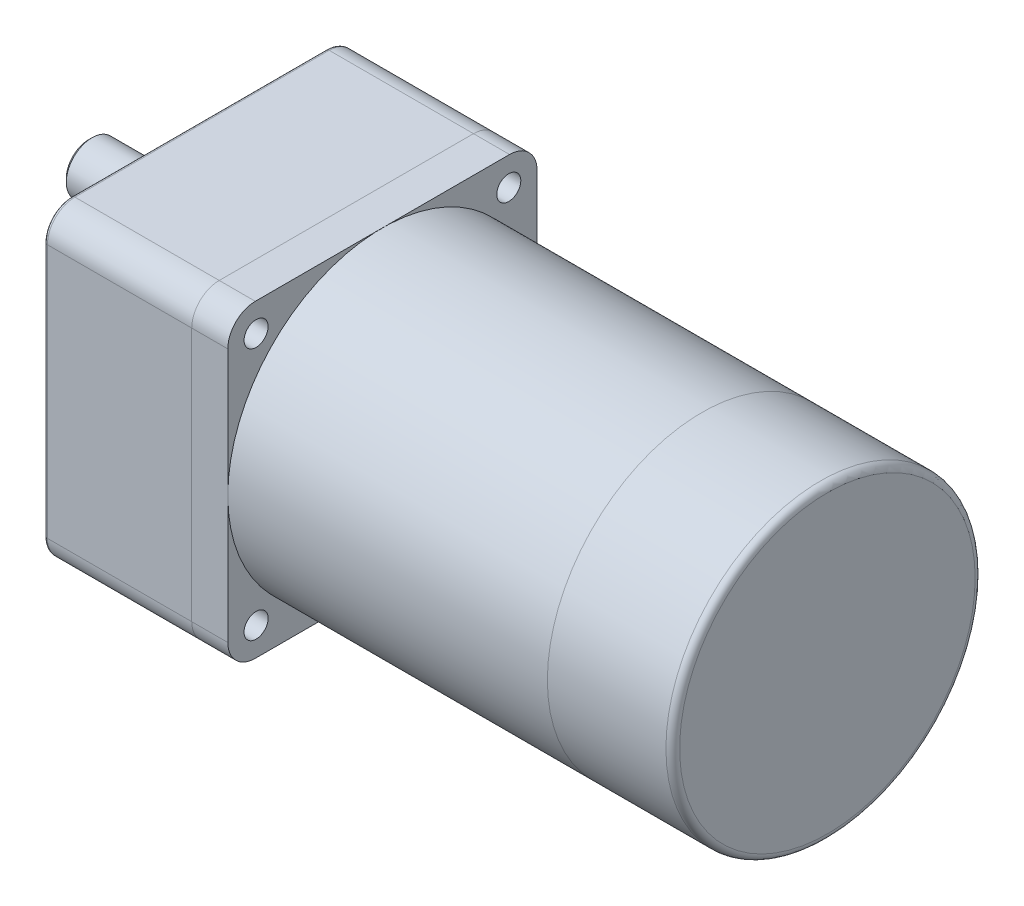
ISO-10303-21;
HEADER;
FILE_DESCRIPTION(('STEP AP214'),'2;1');
FILE_NAME('part.step','',(''),(''),'','','');
FILE_SCHEMA(('AUTOMOTIVE_DESIGN { 1 0 10303 214 1 1 1 1 }'));
ENDSEC;
DATA;
#1=APPLICATION_CONTEXT('core data for automotive mechanical design processes');
#2=APPLICATION_PROTOCOL_DEFINITION('international standard','automotive_design',2000,#1);
#3=PRODUCT_CONTEXT('',#1,'mechanical');
#4=PRODUCT('Part','Part','',(#3));
#5=PRODUCT_RELATED_PRODUCT_CATEGORY('part','',(#4));
#6=PRODUCT_DEFINITION_FORMATION('','',#4);
#7=PRODUCT_DEFINITION_CONTEXT('part definition',#1,'design');
#8=PRODUCT_DEFINITION('design','',#6,#7);
#9=PRODUCT_DEFINITION_SHAPE('','',#8);
#10=(LENGTH_UNIT() NAMED_UNIT(*) SI_UNIT(.MILLI.,.METRE.));
#11=(NAMED_UNIT(*) PLANE_ANGLE_UNIT() SI_UNIT($,.RADIAN.));
#12=(NAMED_UNIT(*) SI_UNIT($,.STERADIAN.) SOLID_ANGLE_UNIT());
#13=UNCERTAINTY_MEASURE_WITH_UNIT(LENGTH_MEASURE(1.E-05),#10,'distance_accuracy_value','');
#14=(GEOMETRIC_REPRESENTATION_CONTEXT(3) GLOBAL_UNCERTAINTY_ASSIGNED_CONTEXT((#13)) GLOBAL_UNIT_ASSIGNED_CONTEXT((#10,
#11,#12)) REPRESENTATION_CONTEXT('',''));
#15=CARTESIAN_POINT('',(0.,0.,0.));
#16=DIRECTION('',(0.,0.,1.));
#17=DIRECTION('',(1.,0.,0.));
#18=AXIS2_PLACEMENT_3D('',#15,#16,#17);
#19=CARTESIAN_POINT('',(183.,0.,0.));
#20=DIRECTION('',(-1.,0.,0.));
#21=DIRECTION('',(0.,0.,1.));
#22=AXIS2_PLACEMENT_3D('',#19,#20,#21);
#23=CYLINDRICAL_SURFACE('',#22,45.);
#24=CARTESIAN_POINT('',(181.,0.,0.));
#25=DIRECTION('',(1.,0.,0.));
#26=DIRECTION('',(0.,0.,-1.));
#27=AXIS2_PLACEMENT_3D('',#24,#25,#26);
#28=CIRCLE('',#27,45.);
#29=CARTESIAN_POINT('',(181.,0.,-45.));
#30=VERTEX_POINT('',#29);
#31=EDGE_CURVE('E11',#30,#30,#28,.F.);
#32=ORIENTED_EDGE('',*,*,#31,.T.);
#33=EDGE_LOOP('',(#32));
#34=FACE_BOUND('',#33,.T.);
#35=CARTESIAN_POINT('',(146.5,0.,0.));
#36=DIRECTION('',(1.,0.,0.));
#37=DIRECTION('',(0.,0.,-1.));
#38=AXIS2_PLACEMENT_3D('',#35,#36,#37);
#39=CIRCLE('',#38,45.);
#40=CARTESIAN_POINT('',(146.5,0.,-45.));
#41=VERTEX_POINT('',#40);
#42=EDGE_CURVE('E53',#41,#41,#39,.T.);
#43=ORIENTED_EDGE('',*,*,#42,.T.);
#44=EDGE_LOOP('',(#43));
#45=FACE_BOUND('',#44,.T.);
#46=ADVANCED_FACE('F42',(#34,#45),#23,.T.);
#47=CARTESIAN_POINT('',(183.,0.,0.));
#48=DIRECTION('',(1.,0.,0.));
#49=DIRECTION('',(0.,0.,-1.));
#50=AXIS2_PLACEMENT_3D('',#47,#48,#49);
#51=PLANE('',#50);
#52=CARTESIAN_POINT('',(183.,0.,0.));
#53=DIRECTION('',(1.,0.,0.));
#54=DIRECTION('',(0.,0.,-1.));
#55=AXIS2_PLACEMENT_3D('',#52,#53,#54);
#56=CIRCLE('',#55,43.);
#57=CARTESIAN_POINT('',(183.,0.,-43.));
#58=VERTEX_POINT('',#57);
#59=EDGE_CURVE('E49',#58,#58,#56,.T.);
#60=ORIENTED_EDGE('',*,*,#59,.T.);
#61=EDGE_LOOP('',(#60));
#62=FACE_BOUND('',#61,.T.);
#63=ADVANCED_FACE('F63',(#62),#51,.T.);
#64=CARTESIAN_POINT('',(146.5,0.,0.));
#65=DIRECTION('',(1.,0.,0.));
#66=DIRECTION('',(0.,0.,-1.));
#67=AXIS2_PLACEMENT_3D('',#64,#65,#66);
#68=PLANE('',#67);
#69=ORIENTED_EDGE('',*,*,#42,.F.);
#70=EDGE_LOOP('',(#69));
#71=FACE_BOUND('',#70,.T.);
#72=ADVANCED_FACE('F61',(#71),#68,.F.);
#73=CARTESIAN_POINT('',(181.,0.,0.));
#74=DIRECTION('',(1.,0.,0.));
#75=DIRECTION('',(0.,0.,-1.));
#76=AXIS2_PLACEMENT_3D('',#73,#74,#75);
#77=TOROIDAL_SURFACE('',#76,43.,2.);
#78=ORIENTED_EDGE('',*,*,#31,.F.);
#79=EDGE_LOOP('',(#78));
#80=FACE_BOUND('',#79,.T.);
#81=ORIENTED_EDGE('',*,*,#59,.F.);
#82=EDGE_LOOP('',(#81));
#83=FACE_BOUND('',#82,.T.);
#84=ADVANCED_FACE('F44',(#80,#83),#77,.T.);
#85=CLOSED_SHELL('',(#46,#63,#72,#84));
#86=MANIFOLD_SOLID_BREP('B2',#85);
#87=CARTESIAN_POINT('',(146.5,0.,0.));
#88=DIRECTION('',(-1.,0.,0.));
#89=DIRECTION('',(0.,0.,1.));
#90=AXIS2_PLACEMENT_3D('',#87,#88,#89);
#91=CYLINDRICAL_SURFACE('',#90,45.);
#92=CARTESIAN_POINT('',(146.5,0.,0.));
#93=DIRECTION('',(1.,0.,0.));
#94=DIRECTION('',(0.,0.,-1.));
#95=AXIS2_PLACEMENT_3D('',#92,#93,#94);
#96=CIRCLE('',#95,45.);
#97=CARTESIAN_POINT('',(146.5,0.,45.));
#98=VERTEX_POINT('',#97);
#99=EDGE_CURVE('E41',#98,#98,#96,.T.);
#100=CARTESIAN_POINT('',(53.5,0.,0.));
#101=DIRECTION('',(1.,0.,0.));
#102=DIRECTION('',(0.,0.,-1.));
#103=AXIS2_PLACEMENT_3D('',#100,#101,#102);
#104=CIRCLE('',#103,45.);
#105=CARTESIAN_POINT('',(53.5,0.,45.));
#106=VERTEX_POINT('',#105);
#107=EDGE_CURVE('E111',#106,#106,#104,.T.);
#108=CARTESIAN_POINT('',(146.5,0.,45.));
#109=CARTESIAN_POINT('',(145.53125,0.,45.));
#110=CARTESIAN_POINT('',(144.5625,0.,45.));
#111=CARTESIAN_POINT('',(142.625,0.,45.));
#112=CARTESIAN_POINT('',(141.65625,0.,45.));
#113=CARTESIAN_POINT('',(139.71875,0.,45.));
#114=CARTESIAN_POINT('',(138.75,0.,45.));
#115=CARTESIAN_POINT('',(136.8125,0.,45.));
#116=CARTESIAN_POINT('',(135.84375,0.,45.));
#117=CARTESIAN_POINT('',(133.90625,0.,45.));
#118=CARTESIAN_POINT('',(132.9375,0.,45.));
#119=CARTESIAN_POINT('',(131.,0.,45.));
#120=CARTESIAN_POINT('',(130.03125,0.,45.));
#121=CARTESIAN_POINT('',(128.09375,0.,45.));
#122=CARTESIAN_POINT('',(127.125,0.,45.));
#123=CARTESIAN_POINT('',(125.1875,0.,45.));
#124=CARTESIAN_POINT('',(124.21875,0.,45.));
#125=CARTESIAN_POINT('',(122.28125,0.,45.));
#126=CARTESIAN_POINT('',(121.3125,0.,45.));
#127=CARTESIAN_POINT('',(119.375,0.,45.));
#128=CARTESIAN_POINT('',(118.40625,0.,45.));
#129=CARTESIAN_POINT('',(116.46875,0.,45.));
#130=CARTESIAN_POINT('',(115.5,0.,45.));
#131=CARTESIAN_POINT('',(113.5625,0.,45.));
#132=CARTESIAN_POINT('',(112.59375,0.,45.));
#133=CARTESIAN_POINT('',(110.65625,0.,45.));
#134=CARTESIAN_POINT('',(109.6875,0.,45.));
#135=CARTESIAN_POINT('',(107.75,0.,45.));
#136=CARTESIAN_POINT('',(106.78125,0.,45.));
#137=CARTESIAN_POINT('',(104.84375,0.,45.));
#138=CARTESIAN_POINT('',(103.875,0.,45.));
#139=CARTESIAN_POINT('',(101.9375,0.,45.));
#140=CARTESIAN_POINT('',(100.96875,0.,45.));
#141=CARTESIAN_POINT('',(99.03125,0.,45.));
#142=CARTESIAN_POINT('',(98.0625,0.,45.));
#143=CARTESIAN_POINT('',(96.125,0.,45.));
#144=CARTESIAN_POINT('',(95.15625,0.,45.));
#145=CARTESIAN_POINT('',(93.21875,0.,45.));
#146=CARTESIAN_POINT('',(92.25,0.,45.));
#147=CARTESIAN_POINT('',(90.3125,0.,45.));
#148=CARTESIAN_POINT('',(89.34375,0.,45.));
#149=CARTESIAN_POINT('',(87.40625,0.,45.));
#150=CARTESIAN_POINT('',(86.4375,0.,45.));
#151=CARTESIAN_POINT('',(84.5,0.,45.));
#152=CARTESIAN_POINT('',(83.53125,0.,45.));
#153=CARTESIAN_POINT('',(81.59375,0.,45.));
#154=CARTESIAN_POINT('',(80.625,0.,45.));
#155=CARTESIAN_POINT('',(78.6875,0.,45.));
#156=CARTESIAN_POINT('',(77.71875,0.,45.));
#157=CARTESIAN_POINT('',(75.78125,0.,45.));
#158=CARTESIAN_POINT('',(74.8125,0.,45.));
#159=CARTESIAN_POINT('',(72.875,0.,45.));
#160=CARTESIAN_POINT('',(71.90625,0.,45.));
#161=CARTESIAN_POINT('',(69.96875,0.,45.));
#162=CARTESIAN_POINT('',(69.,0.,45.));
#163=CARTESIAN_POINT('',(67.0625,0.,45.));
#164=CARTESIAN_POINT('',(66.09375,0.,45.));
#165=CARTESIAN_POINT('',(64.15625,0.,45.));
#166=CARTESIAN_POINT('',(63.1875,0.,45.));
#167=CARTESIAN_POINT('',(61.25,0.,45.));
#168=CARTESIAN_POINT('',(60.28125,0.,45.));
#169=CARTESIAN_POINT('',(58.34375,0.,45.));
#170=CARTESIAN_POINT('',(57.375,0.,45.));
#171=CARTESIAN_POINT('',(55.4375,0.,45.));
#172=CARTESIAN_POINT('',(54.46875,0.,45.));
#173=CARTESIAN_POINT('',(53.5,0.,45.));
#174=B_SPLINE_CURVE_WITH_KNOTS('',3,(#108,#109,#110,#111,#112,#113,#114,#115,#116,#117,#118,
#119,#120,#121,#122,#123,#124,#125,#126,#127,#128,#129,#130,#131,#132,#133,#134,#135,#136,#137,
#138,#139,#140,#141,#142,#143,#144,#145,#146,#147,#148,#149,#150,#151,#152,#153,#154,#155,#156,
#157,#158,#159,#160,#161,#162,#163,#164,#165,#166,#167,#168,#169,#170,#171,#172,#173),
.UNSPECIFIED.,.F.,.F.,(4,2,2,2,2,2,2,2,2,2,2,2,2,2,2,2,2,2,2,2,2,2,2,2,2,2,2,2,2,2,2,2,4),(0.,
2.90625000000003,5.81250000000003,8.71875000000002,11.625,14.53125,17.4375,20.34375,23.25,
26.15625,29.0625,31.96875,34.875,37.78125,40.6875,43.59375,46.5,49.40625,52.3125,55.21875,
58.125,61.03125,63.9375,66.84375,69.75,72.65625,75.5625,78.46875,81.375,84.28125,87.1875,
90.09375,93.),.UNSPECIFIED.);
#175=EDGE_CURVE('BSEAM108',#98,#106,#174,.T.);
#176=ORIENTED_EDGE('',*,*,#99,.F.);
#177=ORIENTED_EDGE('',*,*,#107,.T.);
#178=ORIENTED_EDGE('',*,*,#175,.T.);
#179=ORIENTED_EDGE('',*,*,#175,.F.);
#180=EDGE_LOOP('',(#176,#178,#177,#179));
#181=FACE_BOUND('',#180,.T.);
#182=ADVANCED_FACE('F108',(#181),#91,.T.);
#183=CARTESIAN_POINT('',(146.5,0.,0.));
#184=DIRECTION('',(1.,0.,0.));
#185=DIRECTION('',(0.,0.,-1.));
#186=AXIS2_PLACEMENT_3D('',#183,#184,#185);
#187=PLANE('',#186);
#188=ORIENTED_EDGE('',*,*,#99,.T.);
#189=EDGE_LOOP('',(#188));
#190=FACE_BOUND('',#189,.T.);
#191=ADVANCED_FACE('F123',(#190),#187,.T.);
#192=CARTESIAN_POINT('',(53.5,0.,0.));
#193=DIRECTION('',(1.,0.,0.));
#194=DIRECTION('',(0.,0.,-1.));
#195=AXIS2_PLACEMENT_3D('',#192,#193,#194);
#196=PLANE('',#195);
#197=ORIENTED_EDGE('',*,*,#107,.F.);
#198=EDGE_LOOP('',(#197));
#199=FACE_BOUND('',#198,.T.);
#200=ADVANCED_FACE('F121',(#199),#196,.F.);
#201=CLOSED_SHELL('',(#182,#191,#200));
#202=MANIFOLD_SOLID_BREP('B6',#201);
#203=CARTESIAN_POINT('',(-32.,18.,0.));
#204=DIRECTION('',(1.,0.,0.));
#205=DIRECTION('',(0.,0.,-1.));
#206=AXIS2_PLACEMENT_3D('',#203,#204,#205);
#207=CYLINDRICAL_SURFACE('',#206,7.5);
#208=CARTESIAN_POINT('',(-3.,18.,0.));
#209=DIRECTION('',(-1.,0.,0.));
#210=DIRECTION('',(0.,0.,1.));
#211=AXIS2_PLACEMENT_3D('',#208,#209,#210);
#212=CIRCLE('',#211,7.5);
#213=CARTESIAN_POINT('',(-3.,18.,7.5));
#214=VERTEX_POINT('',#213);
#215=EDGE_CURVE('E237',#214,#214,#212,.T.);
#216=ORIENTED_EDGE('',*,*,#215,.T.);
#217=EDGE_LOOP('',(#216));
#218=FACE_BOUND('',#217,.T.);
#219=DIRECTION('',(1.,0.,0.));
#220=VECTOR('',#219,1.);
#221=CARTESIAN_POINT('',(-32.,20.5,-7.07106781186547));
#222=LINE('',#221,#220);
#223=CARTESIAN_POINT('',(-31.,20.5,-7.07106781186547));
#224=VERTEX_POINT('',#223);
#225=CARTESIAN_POINT('',(-9.5,20.5,-7.07106781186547));
#226=VERTEX_POINT('',#225);
#227=EDGE_CURVE('E226',#224,#226,#222,.T.);
#228=ORIENTED_EDGE('',*,*,#227,.F.);
#229=CARTESIAN_POINT('',(-31.,18.,0.));
#230=DIRECTION('',(-1.,0.,0.));
#231=DIRECTION('',(0.,0.,1.));
#232=AXIS2_PLACEMENT_3D('',#229,#230,#231);
#233=CIRCLE('',#232,7.5);
#234=CARTESIAN_POINT('',(-31.,15.5,-7.07106781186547));
#235=VERTEX_POINT('',#234);
#236=EDGE_CURVE('E170',#224,#235,#233,.F.);
#237=ORIENTED_EDGE('',*,*,#236,.T.);
#238=DIRECTION('',(1.,0.,0.));
#239=VECTOR('',#238,1.);
#240=CARTESIAN_POINT('',(-32.,15.5,-7.07106781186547));
#241=LINE('',#240,#239);
#242=CARTESIAN_POINT('',(-9.5,15.5,-7.07106781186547));
#243=VERTEX_POINT('',#242);
#244=EDGE_CURVE('E228',#243,#235,#241,.F.);
#245=ORIENTED_EDGE('',*,*,#244,.F.);
#246=CARTESIAN_POINT('',(-9.5,20.5,-7.07106781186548));
#247=CARTESIAN_POINT('',(-9.43179292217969,20.5000089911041,-7.07105693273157));
#248=CARTESIAN_POINT('',(-9.36359192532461,20.4972088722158,-7.07205443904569));
#249=CARTESIAN_POINT('',(-9.22771896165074,20.4860604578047,-7.07598524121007));
#250=CARTESIAN_POINT('',(-9.16004685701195,20.477713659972,-7.07891801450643));
#251=CARTESIAN_POINT('',(-9.02590951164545,20.455574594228,-7.08662705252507));
#252=CARTESIAN_POINT('',(-8.95944129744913,20.4417984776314,-7.09139784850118));
#253=CARTESIAN_POINT('',(-8.8279917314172,20.4089418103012,-7.10262619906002));
#254=CARTESIAN_POINT('',(-8.7630104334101,20.3898610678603,-7.10908381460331));
#255=CARTESIAN_POINT('',(-8.57103842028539,20.324915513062,-7.13069940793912));
#256=CARTESIAN_POINT('',(-8.44682084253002,20.2713141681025,-7.14811243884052));
#257=CARTESIAN_POINT('',(-8.20912318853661,20.1451778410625,-7.1869703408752));
#258=CARTESIAN_POINT('',(-8.09564976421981,20.0726312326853,-7.20841768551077));
#259=CARTESIAN_POINT('',(-7.8782070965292,19.9076299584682,-7.25386182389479));
#260=CARTESIAN_POINT('',(-7.7747148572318,19.8145628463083,-7.27792189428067));
#261=CARTESIAN_POINT('',(-7.5844828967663,19.6124707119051,-7.32534626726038));
#262=CARTESIAN_POINT('',(-7.497746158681,19.5034428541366,-7.34871044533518));
#263=CARTESIAN_POINT('',(-7.34130177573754,19.2690092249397,-7.39284706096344));
#264=CARTESIAN_POINT('',(-7.27209769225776,19.1432502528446,-7.41353593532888));
#265=CARTESIAN_POINT('',(-7.1560192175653,18.8810730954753,-7.44924021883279));
#266=CARTESIAN_POINT('',(-7.10913800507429,18.7446581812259,-7.46425736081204));
#267=CARTESIAN_POINT('',(-7.04066072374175,18.4700733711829,-7.48647677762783));
#268=CARTESIAN_POINT('',(-7.01824182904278,18.3321295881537,-7.49393272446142));
#269=CARTESIAN_POINT('',(-6.99670924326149,18.0542474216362,-7.50109021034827));
#270=CARTESIAN_POINT('',(-6.99758999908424,17.9143095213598,-7.50079359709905));
#271=CARTESIAN_POINT('',(-7.0221107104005,17.6422403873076,-7.49265096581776));
#272=CARTESIAN_POINT('',(-7.04485659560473,17.5100182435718,-7.48510152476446));
#273=CARTESIAN_POINT('',(-7.1109829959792,17.2513898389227,-7.46367401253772));
#274=CARTESIAN_POINT('',(-7.15436465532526,17.1249839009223,-7.44979559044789));
#275=CARTESIAN_POINT('',(-7.26105342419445,16.8796184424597,-7.41689170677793));
#276=CARTESIAN_POINT('',(-7.32461511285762,16.760778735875,-7.39780094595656));
#277=CARTESIAN_POINT('',(-7.46964987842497,16.5351885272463,-7.35645969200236));
#278=CARTESIAN_POINT('',(-7.55112782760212,16.4284413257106,-7.33420833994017));
#279=CARTESIAN_POINT('',(-7.73417762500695,16.2247566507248,-7.28765679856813));
#280=CARTESIAN_POINT('',(-7.83651385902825,16.128515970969,-7.26330946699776));
#281=CARTESIAN_POINT('',(-8.05610372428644,15.9543199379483,-7.21618726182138));
#282=CARTESIAN_POINT('',(-8.17336215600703,15.8763704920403,-7.19341289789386));
#283=CARTESIAN_POINT('',(-8.42170044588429,15.7399916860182,-7.15175078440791));
#284=CARTESIAN_POINT('',(-8.55295878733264,15.6818674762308,-7.13292537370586));
#285=CARTESIAN_POINT('',(-8.8241174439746,15.5888494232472,-7.10202742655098));
#286=CARTESIAN_POINT('',(-8.96400373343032,15.5539189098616,-7.08994423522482));
#287=CARTESIAN_POINT('',(-9.17104659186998,15.5208546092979,-7.078413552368));
#288=CARTESIAN_POINT('',(-9.23660347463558,15.5130373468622,-7.07566669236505));
#289=CARTESIAN_POINT('',(-9.36809519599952,15.502613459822,-7.07199258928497));
#290=CARTESIAN_POINT('',(-9.43402943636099,15.5000001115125,-7.0710629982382));
#291=CARTESIAN_POINT('',(-9.5,15.5,-7.07106781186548));
#292=B_SPLINE_CURVE_WITH_KNOTS('',3,(#246,#247,#248,#249,#250,#251,#252,#253,#254,#255,#256,
#257,#258,#259,#260,#261,#262,#263,#264,#265,#266,#267,#268,#269,#270,#271,#272,#273,#274,#275,
#276,#277,#278,#279,#280,#281,#282,#283,#284,#285,#286,#287,#288,#289,#290,#291),.UNSPECIFIED.,
.F.,.F.,(4,2,2,2,2,2,2,2,2,2,2,2,2,2,2,2,2,2,2,2,2,2,4),(0.,0.20454621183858,0.409037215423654,
0.612924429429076,0.816819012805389,1.22401016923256,1.63145179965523,2.0532786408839,
2.47518051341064,2.90809434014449,3.34087579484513,3.75860278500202,4.17623021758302,
4.57747647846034,4.97874498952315,5.38529148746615,5.79194868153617,6.21771736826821,
6.64362337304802,7.07581676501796,7.50732520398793,7.70536340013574,7.90314555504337),.UNSPECIFIED.);
#293=EDGE_CURVE('E240',#226,#243,#292,.T.);
#294=ORIENTED_EDGE('',*,*,#293,.F.);
#295=EDGE_LOOP('',(#228,#237,#245,#294));
#296=FACE_BOUND('',#295,.T.);
#297=ADVANCED_FACE('F157',(#218,#296),#207,.T.);
#298=CARTESIAN_POINT('',(-32.,18.,0.));
#299=DIRECTION('',(-1.,0.,0.));
#300=DIRECTION('',(0.,0.,1.));
#301=AXIS2_PLACEMENT_3D('',#298,#299,#300);
#302=PLANE('',#301);
#303=DIRECTION('',(0.,0.,-1.));
#304=VECTOR('',#303,1.);
#305=CARTESIAN_POINT('',(-32.,15.5,-4.5));
#306=LINE('',#305,#304);
#307=CARTESIAN_POINT('',(-32.,15.5,-4.5));
#308=VERTEX_POINT('',#307);
#309=CARTESIAN_POINT('',(-32.,15.5,-6.00000000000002));
#310=VERTEX_POINT('',#309);
#311=EDGE_CURVE('E232',#308,#310,#306,.T.);
#312=ORIENTED_EDGE('',*,*,#311,.T.);
#313=CARTESIAN_POINT('',(-32.,18.,0.));
#314=DIRECTION('',(-1.,0.,0.));
#315=DIRECTION('',(0.,0.,1.));
#316=AXIS2_PLACEMENT_3D('',#313,#314,#315);
#317=CIRCLE('',#316,6.50000000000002);
#318=CARTESIAN_POINT('',(-32.,20.5,-6.00000000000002));
#319=VERTEX_POINT('',#318);
#320=EDGE_CURVE('E246',#310,#319,#317,.T.);
#321=ORIENTED_EDGE('',*,*,#320,.T.);
#322=DIRECTION('',(0.,0.,-1.));
#323=VECTOR('',#322,1.);
#324=CARTESIAN_POINT('',(-32.,20.5,-4.5));
#325=LINE('',#324,#323);
#326=CARTESIAN_POINT('',(-32.,20.5,-4.5));
#327=VERTEX_POINT('',#326);
#328=EDGE_CURVE('E229',#327,#319,#325,.T.);
#329=ORIENTED_EDGE('',*,*,#328,.F.);
#330=DIRECTION('',(0.,-1.,0.));
#331=VECTOR('',#330,1.);
#332=CARTESIAN_POINT('',(-32.,20.5,-4.5));
#333=LINE('',#332,#331);
#334=EDGE_CURVE('E213',#327,#308,#333,.T.);
#335=ORIENTED_EDGE('',*,*,#334,.T.);
#336=EDGE_LOOP('',(#312,#321,#329,#335));
#337=FACE_BOUND('',#336,.T.);
#338=ADVANCED_FACE('F256',(#337),#302,.T.);
#339=CARTESIAN_POINT('',(-3.,18.,0.));
#340=DIRECTION('',(-1.,0.,0.));
#341=DIRECTION('',(0.,0.,1.));
#342=AXIS2_PLACEMENT_3D('',#339,#340,#341);
#343=PLANE('',#342);
#344=ORIENTED_EDGE('',*,*,#215,.F.);
#345=EDGE_LOOP('',(#344));
#346=FACE_BOUND('',#345,.T.);
#347=ADVANCED_FACE('F254',(#346),#343,.F.);
#348=CARTESIAN_POINT('',(-9.5,18.,-4.5));
#349=DIRECTION('',(0.,0.,-1.));
#350=DIRECTION('',(-1.,0.,0.));
#351=AXIS2_PLACEMENT_3D('',#348,#349,#350);
#352=CYLINDRICAL_SURFACE('',#351,2.5);
#353=DIRECTION('',(0.,0.,-1.));
#354=VECTOR('',#353,1.);
#355=CARTESIAN_POINT('',(-9.5,20.5,-4.5));
#356=LINE('',#355,#354);
#357=CARTESIAN_POINT('',(-9.5,20.5,-4.5));
#358=VERTEX_POINT('',#357);
#359=EDGE_CURVE('E221',#358,#226,#356,.T.);
#360=ORIENTED_EDGE('',*,*,#359,.T.);
#361=ORIENTED_EDGE('',*,*,#293,.T.);
#362=DIRECTION('',(0.,0.,-1.));
#363=VECTOR('',#362,1.);
#364=CARTESIAN_POINT('',(-9.5,15.5,-4.5));
#365=LINE('',#364,#363);
#366=CARTESIAN_POINT('',(-9.5,15.5,-4.5));
#367=VERTEX_POINT('',#366);
#368=EDGE_CURVE('E223',#367,#243,#365,.T.);
#369=ORIENTED_EDGE('',*,*,#368,.F.);
#370=CARTESIAN_POINT('',(-9.5,18.,-4.5));
#371=DIRECTION('',(0.,0.,1.));
#372=DIRECTION('',(1.,0.,0.));
#373=AXIS2_PLACEMENT_3D('',#370,#371,#372);
#374=CIRCLE('',#373,2.5);
#375=EDGE_CURVE('E211',#367,#358,#374,.T.);
#376=ORIENTED_EDGE('',*,*,#375,.T.);
#377=EDGE_LOOP('',(#360,#361,#369,#376));
#378=FACE_BOUND('',#377,.T.);
#379=ADVANCED_FACE('F220',(#378),#352,.F.);
#380=CARTESIAN_POINT('',(-9.5,20.5,-4.5));
#381=DIRECTION('',(0.,-1.,0.));
#382=DIRECTION('',(0.,0.,-1.));
#383=AXIS2_PLACEMENT_3D('',#380,#381,#382);
#384=PLANE('',#383);
#385=ORIENTED_EDGE('',*,*,#328,.T.);
#386=CARTESIAN_POINT('',(-32.,20.5,-6.00000000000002));
#387=CARTESIAN_POINT('',(-31.9171731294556,20.5,-6.0897273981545));
#388=CARTESIAN_POINT('',(-31.8341996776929,20.5,-6.17931930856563));
#389=CARTESIAN_POINT('',(-31.6679908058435,20.5,-6.35825867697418));
#390=CARTESIAN_POINT('',(-31.5847553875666,20.5,-6.44760613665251));
#391=CARTESIAN_POINT('',(-31.4180527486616,20.5,-6.62608424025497));
#392=CARTESIAN_POINT('',(-31.3345855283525,20.5,-6.7152148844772));
#393=CARTESIAN_POINT('',(-31.1674427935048,20.5,-6.89328182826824));
#394=CARTESIAN_POINT('',(-31.0837672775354,20.5,-6.98221812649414));
#395=CARTESIAN_POINT('',(-31.,20.5,-7.07106781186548));
#396=B_SPLINE_CURVE_WITH_KNOTS('',3,(#386,#387,#388,#389,#390,#391,#392,#393,#394,#395),
.UNSPECIFIED.,.F.,.F.,(4,2,2,2,4),(0.,0.366335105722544,0.732667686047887,1.0989997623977,
1.46533436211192),.UNSPECIFIED.);
#397=EDGE_CURVE('E184',#319,#224,#396,.T.);
#398=ORIENTED_EDGE('',*,*,#397,.T.);
#399=ORIENTED_EDGE('',*,*,#227,.T.);
#400=ORIENTED_EDGE('',*,*,#359,.F.);
#401=DIRECTION('',(-1.,0.,0.));
#402=VECTOR('',#401,1.);
#403=CARTESIAN_POINT('',(-9.5,20.5,-4.5));
#404=LINE('',#403,#402);
#405=EDGE_CURVE('E208',#358,#327,#404,.T.);
#406=ORIENTED_EDGE('',*,*,#405,.T.);
#407=EDGE_LOOP('',(#385,#398,#399,#400,#406));
#408=FACE_BOUND('',#407,.T.);
#409=ADVANCED_FACE('F225',(#408),#384,.T.);
#410=CARTESIAN_POINT('',(-32.,15.5,-4.5));
#411=DIRECTION('',(0.,1.,0.));
#412=DIRECTION('',(0.,0.,1.));
#413=AXIS2_PLACEMENT_3D('',#410,#411,#412);
#414=PLANE('',#413);
#415=ORIENTED_EDGE('',*,*,#244,.T.);
#416=CARTESIAN_POINT('',(-31.,15.5,-7.07106781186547));
#417=CARTESIAN_POINT('',(-31.0837672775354,15.5,-6.98221812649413));
#418=CARTESIAN_POINT('',(-31.1674427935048,15.5,-6.89328182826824));
#419=CARTESIAN_POINT('',(-31.3345855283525,15.5,-6.7152148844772));
#420=CARTESIAN_POINT('',(-31.4180527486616,15.5,-6.62608424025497));
#421=CARTESIAN_POINT('',(-31.5847553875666,15.5,-6.44760613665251));
#422=CARTESIAN_POINT('',(-31.6679908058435,15.5,-6.35825867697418));
#423=CARTESIAN_POINT('',(-31.8341996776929,15.5,-6.17931930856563));
#424=CARTESIAN_POINT('',(-31.9171731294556,15.5,-6.08972739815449));
#425=CARTESIAN_POINT('',(-32.,15.5,-6.00000000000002));
#426=B_SPLINE_CURVE_WITH_KNOTS('',3,(#416,#417,#418,#419,#420,#421,#422,#423,#424,#425),
.UNSPECIFIED.,.F.,.F.,(4,2,2,2,4),(0.,0.366334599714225,0.732666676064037,1.09899925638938,
1.46533436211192),.UNSPECIFIED.);
#427=EDGE_CURVE('E106',#235,#310,#426,.T.);
#428=ORIENTED_EDGE('',*,*,#427,.T.);
#429=ORIENTED_EDGE('',*,*,#311,.F.);
#430=DIRECTION('',(1.,0.,0.));
#431=VECTOR('',#430,1.);
#432=CARTESIAN_POINT('',(-32.,15.5,-4.5));
#433=LINE('',#432,#431);
#434=EDGE_CURVE('E278',#308,#367,#433,.T.);
#435=ORIENTED_EDGE('',*,*,#434,.T.);
#436=ORIENTED_EDGE('',*,*,#368,.T.);
#437=EDGE_LOOP('',(#415,#428,#429,#435,#436));
#438=FACE_BOUND('',#437,.T.);
#439=ADVANCED_FACE('F282',(#438),#414,.T.);
#440=CARTESIAN_POINT('',(-9.5,18.,-4.5));
#441=DIRECTION('',(0.,0.,1.));
#442=DIRECTION('',(1.,0.,0.));
#443=AXIS2_PLACEMENT_3D('',#440,#441,#442);
#444=PLANE('',#443);
#445=ORIENTED_EDGE('',*,*,#375,.F.);
#446=ORIENTED_EDGE('',*,*,#434,.F.);
#447=ORIENTED_EDGE('',*,*,#334,.F.);
#448=ORIENTED_EDGE('',*,*,#405,.F.);
#449=EDGE_LOOP('',(#445,#446,#447,#448));
#450=FACE_BOUND('',#449,.T.);
#451=ADVANCED_FACE('F210',(#450),#444,.F.);
#452=CARTESIAN_POINT('',(-32.,18.,0.));
#453=DIRECTION('',(1.,0.,0.));
#454=DIRECTION('',(0.,0.,-1.));
#455=AXIS2_PLACEMENT_3D('',#452,#453,#454);
#456=CONICAL_SURFACE('',#455,6.50000000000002,0.785398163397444);
#457=ORIENTED_EDGE('',*,*,#427,.F.);
#458=ORIENTED_EDGE('',*,*,#236,.F.);
#459=ORIENTED_EDGE('',*,*,#397,.F.);
#460=ORIENTED_EDGE('',*,*,#320,.F.);
#461=EDGE_LOOP('',(#457,#458,#459,#460));
#462=FACE_BOUND('',#461,.T.);
#463=ADVANCED_FACE('F159',(#462),#456,.T.);
#464=CLOSED_SHELL('',(#297,#338,#347,#379,#409,#439,#451,#463));
#465=MANIFOLD_SOLID_BREP('B36',#464);
#466=CARTESIAN_POINT('',(-3.,18.,0.));
#467=DIRECTION('',(1.,0.,0.));
#468=DIRECTION('',(0.,0.,-1.));
#469=AXIS2_PLACEMENT_3D('',#466,#467,#468);
#470=CYLINDRICAL_SURFACE('',#469,16.);
#471=CARTESIAN_POINT('',(-2.5,18.,0.));
#472=DIRECTION('',(-1.,0.,0.));
#473=DIRECTION('',(0.,0.,1.));
#474=AXIS2_PLACEMENT_3D('',#471,#472,#473);
#475=CIRCLE('',#474,16.);
#476=CARTESIAN_POINT('',(-2.5,18.,16.));
#477=VERTEX_POINT('',#476);
#478=EDGE_CURVE('E156',#477,#477,#475,.F.);
#479=ORIENTED_EDGE('',*,*,#478,.T.);
#480=EDGE_LOOP('',(#479));
#481=FACE_BOUND('',#480,.T.);
#482=CARTESIAN_POINT('',(0.,18.,0.));
#483=DIRECTION('',(-1.,0.,0.));
#484=DIRECTION('',(0.,0.,1.));
#485=AXIS2_PLACEMENT_3D('',#482,#483,#484);
#486=CIRCLE('',#485,16.);
#487=CARTESIAN_POINT('',(0.,18.,16.));
#488=VERTEX_POINT('',#487);
#489=EDGE_CURVE('E358',#488,#488,#486,.T.);
#490=ORIENTED_EDGE('',*,*,#489,.T.);
#491=EDGE_LOOP('',(#490));
#492=FACE_BOUND('',#491,.T.);
#493=ADVANCED_FACE('F347',(#481,#492),#470,.T.);
#494=CARTESIAN_POINT('',(-3.,18.,0.));
#495=DIRECTION('',(-1.,0.,0.));
#496=DIRECTION('',(0.,0.,1.));
#497=AXIS2_PLACEMENT_3D('',#494,#495,#496);
#498=PLANE('',#497);
#499=CARTESIAN_POINT('',(-3.,18.,0.));
#500=DIRECTION('',(-1.,0.,0.));
#501=DIRECTION('',(0.,0.,1.));
#502=AXIS2_PLACEMENT_3D('',#499,#500,#501);
#503=CIRCLE('',#502,15.5);
#504=CARTESIAN_POINT('',(-3.,18.,15.5));
#505=VERTEX_POINT('',#504);
#506=EDGE_CURVE('E354',#505,#505,#503,.T.);
#507=ORIENTED_EDGE('',*,*,#506,.T.);
#508=EDGE_LOOP('',(#507));
#509=FACE_BOUND('',#508,.T.);
#510=ADVANCED_FACE('F368',(#509),#498,.T.);
#511=CARTESIAN_POINT('',(0.,18.,0.));
#512=DIRECTION('',(-1.,0.,0.));
#513=DIRECTION('',(0.,0.,1.));
#514=AXIS2_PLACEMENT_3D('',#511,#512,#513);
#515=PLANE('',#514);
#516=ORIENTED_EDGE('',*,*,#489,.F.);
#517=EDGE_LOOP('',(#516));
#518=FACE_BOUND('',#517,.T.);
#519=ADVANCED_FACE('F366',(#518),#515,.F.);
#520=CARTESIAN_POINT('',(-2.5,18.,0.));
#521=DIRECTION('',(-1.,0.,0.));
#522=DIRECTION('',(0.,0.,1.));
#523=AXIS2_PLACEMENT_3D('',#520,#521,#522);
#524=TOROIDAL_SURFACE('',#523,15.5,0.5);
#525=ORIENTED_EDGE('',*,*,#478,.F.);
#526=EDGE_LOOP('',(#525));
#527=FACE_BOUND('',#526,.T.);
#528=ORIENTED_EDGE('',*,*,#506,.F.);
#529=EDGE_LOOP('',(#528));
#530=FACE_BOUND('',#529,.T.);
#531=ADVANCED_FACE('F349',(#527,#530),#524,.T.);
#532=CLOSED_SHELL('',(#493,#510,#519,#531));
#533=MANIFOLD_SOLID_BREP('B100',#532);
#534=CARTESIAN_POINT('',(53.5,37.,-37.));
#535=DIRECTION('',(-1.,0.,0.));
#536=DIRECTION('',(0.,0.,1.));
#537=AXIS2_PLACEMENT_3D('',#534,#535,#536);
#538=CYLINDRICAL_SURFACE('',#537,8.);
#539=CARTESIAN_POINT('',(43.,37.,-37.));
#540=DIRECTION('',(1.,0.,0.));
#541=DIRECTION('',(0.,0.,1.));
#542=AXIS2_PLACEMENT_3D('',#539,#540,#541);
#543=CIRCLE('',#542,8.);
#544=CARTESIAN_POINT('',(43.,37.,-45.));
#545=VERTEX_POINT('',#544);
#546=CARTESIAN_POINT('',(43.,45.,-36.9999999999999));
#547=VERTEX_POINT('',#546);
#548=EDGE_CURVE('E510',#545,#547,#543,.T.);
#549=ORIENTED_EDGE('',*,*,#548,.T.);
#550=DIRECTION('',(-1.,0.,0.));
#551=VECTOR('',#550,1.);
#552=CARTESIAN_POINT('',(53.5,45.,-36.9999999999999));
#553=LINE('',#552,#551);
#554=CARTESIAN_POINT('',(53.5,45.,-36.9999999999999));
#555=VERTEX_POINT('',#554);
#556=EDGE_CURVE('E345',#555,#547,#553,.T.);
#557=ORIENTED_EDGE('',*,*,#556,.F.);
#558=CARTESIAN_POINT('',(53.5,37.,-37.));
#559=DIRECTION('',(1.,0.,0.));
#560=DIRECTION('',(0.,0.,1.));
#561=AXIS2_PLACEMENT_3D('',#558,#559,#560);
#562=CIRCLE('',#561,8.);
#563=CARTESIAN_POINT('',(53.5,37.,-45.));
#564=VERTEX_POINT('',#563);
#565=EDGE_CURVE('E524',#564,#555,#562,.T.);
#566=ORIENTED_EDGE('',*,*,#565,.F.);
#567=DIRECTION('',(-1.,0.,0.));
#568=VECTOR('',#567,1.);
#569=CARTESIAN_POINT('',(53.5,37.,-45.));
#570=LINE('',#569,#568);
#571=EDGE_CURVE('E506',#564,#545,#570,.T.);
#572=ORIENTED_EDGE('',*,*,#571,.T.);
#573=EDGE_LOOP('',(#549,#557,#566,#572));
#574=FACE_BOUND('',#573,.T.);
#575=ADVANCED_FACE('F412',(#574),#538,.T.);
#576=CARTESIAN_POINT('',(53.5,45.,36.9999999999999));
#577=DIRECTION('',(0.,-1.,0.));
#578=DIRECTION('',(0.,0.,-1.));
#579=AXIS2_PLACEMENT_3D('',#576,#577,#578);
#580=PLANE('',#579);
#581=DIRECTION('',(0.,0.,1.));
#582=VECTOR('',#581,1.);
#583=CARTESIAN_POINT('',(43.,45.,36.9999999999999));
#584=LINE('',#583,#582);
#585=CARTESIAN_POINT('',(43.,45.,36.9999999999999));
#586=VERTEX_POINT('',#585);
#587=EDGE_CURVE('E513',#547,#586,#584,.T.);
#588=ORIENTED_EDGE('',*,*,#587,.T.);
#589=DIRECTION('',(-1.,0.,0.));
#590=VECTOR('',#589,1.);
#591=CARTESIAN_POINT('',(53.5,45.,36.9999999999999));
#592=LINE('',#591,#590);
#593=CARTESIAN_POINT('',(53.5,45.,36.9999999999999));
#594=VERTEX_POINT('',#593);
#595=EDGE_CURVE('E421',#594,#586,#592,.T.);
#596=ORIENTED_EDGE('',*,*,#595,.F.);
#597=DIRECTION('',(0.,0.,1.));
#598=VECTOR('',#597,1.);
#599=CARTESIAN_POINT('',(53.5,45.,36.9999999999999));
#600=LINE('',#599,#598);
#601=EDGE_CURVE('E473',#555,#594,#600,.T.);
#602=ORIENTED_EDGE('',*,*,#601,.F.);
#603=ORIENTED_EDGE('',*,*,#556,.T.);
#604=EDGE_LOOP('',(#588,#596,#602,#603));
#605=FACE_BOUND('',#604,.T.);
#606=ADVANCED_FACE('F578',(#605),#580,.F.);
#607=CARTESIAN_POINT('',(53.5,37.,37.));
#608=DIRECTION('',(-1.,0.,0.));
#609=DIRECTION('',(0.,0.,1.));
#610=AXIS2_PLACEMENT_3D('',#607,#608,#609);
#611=CYLINDRICAL_SURFACE('',#610,8.);
#612=CARTESIAN_POINT('',(43.,37.,37.));
#613=DIRECTION('',(1.,0.,0.));
#614=DIRECTION('',(0.,0.,1.));
#615=AXIS2_PLACEMENT_3D('',#612,#613,#614);
#616=CIRCLE('',#615,8.);
#617=CARTESIAN_POINT('',(43.,37.,45.));
#618=VERTEX_POINT('',#617);
#619=EDGE_CURVE('E515',#586,#618,#616,.T.);
#620=ORIENTED_EDGE('',*,*,#619,.T.);
#621=DIRECTION('',(-1.,0.,0.));
#622=VECTOR('',#621,1.);
#623=CARTESIAN_POINT('',(53.5,37.,45.));
#624=LINE('',#623,#622);
#625=CARTESIAN_POINT('',(53.5,37.,45.));
#626=VERTEX_POINT('',#625);
#627=EDGE_CURVE('E531',#626,#618,#624,.T.);
#628=ORIENTED_EDGE('',*,*,#627,.F.);
#629=CARTESIAN_POINT('',(53.5,37.,37.));
#630=DIRECTION('',(1.,0.,0.));
#631=DIRECTION('',(0.,0.,1.));
#632=AXIS2_PLACEMENT_3D('',#629,#630,#631);
#633=CIRCLE('',#632,8.);
#634=EDGE_CURVE('E679',#594,#626,#633,.T.);
#635=ORIENTED_EDGE('',*,*,#634,.F.);
#636=ORIENTED_EDGE('',*,*,#595,.T.);
#637=EDGE_LOOP('',(#620,#628,#635,#636));
#638=FACE_BOUND('',#637,.T.);
#639=ADVANCED_FACE('F582',(#638),#611,.T.);
#640=CARTESIAN_POINT('',(53.5,-37.,45.));
#641=DIRECTION('',(0.,0.,-1.));
#642=DIRECTION('',(-1.,0.,0.));
#643=AXIS2_PLACEMENT_3D('',#640,#641,#642);
#644=PLANE('',#643);
#645=DIRECTION('',(0.,-1.,0.));
#646=VECTOR('',#645,1.);
#647=CARTESIAN_POINT('',(43.,-37.,45.));
#648=LINE('',#647,#646);
#649=CARTESIAN_POINT('',(43.,-37.,45.));
#650=VERTEX_POINT('',#649);
#651=EDGE_CURVE('E517',#618,#650,#648,.T.);
#652=ORIENTED_EDGE('',*,*,#651,.T.);
#653=DIRECTION('',(-1.,0.,0.));
#654=VECTOR('',#653,1.);
#655=CARTESIAN_POINT('',(53.5,-37.,45.));
#656=LINE('',#655,#654);
#657=CARTESIAN_POINT('',(53.5,-37.,45.));
#658=VERTEX_POINT('',#657);
#659=EDGE_CURVE('E528',#658,#650,#656,.T.);
#660=ORIENTED_EDGE('',*,*,#659,.F.);
#661=DIRECTION('',(0.,-1.,0.));
#662=VECTOR('',#661,1.);
#663=CARTESIAN_POINT('',(53.5,-37.,45.));
#664=LINE('',#663,#662);
#665=EDGE_CURVE('E681',#626,#658,#664,.T.);
#666=ORIENTED_EDGE('',*,*,#665,.F.);
#667=ORIENTED_EDGE('',*,*,#627,.T.);
#668=EDGE_LOOP('',(#652,#660,#666,#667));
#669=FACE_BOUND('',#668,.T.);
#670=ADVANCED_FACE('F586',(#669),#644,.F.);
#671=CARTESIAN_POINT('',(53.5,-37.,37.));
#672=DIRECTION('',(-1.,0.,0.));
#673=DIRECTION('',(0.,0.,1.));
#674=AXIS2_PLACEMENT_3D('',#671,#672,#673);
#675=CYLINDRICAL_SURFACE('',#674,8.);
#676=CARTESIAN_POINT('',(43.,-37.,37.));
#677=DIRECTION('',(1.,0.,0.));
#678=DIRECTION('',(0.,0.,1.));
#679=AXIS2_PLACEMENT_3D('',#676,#677,#678);
#680=CIRCLE('',#679,8.);
#681=CARTESIAN_POINT('',(43.,-45.,36.9999999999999));
#682=VERTEX_POINT('',#681);
#683=EDGE_CURVE('E519',#650,#682,#680,.T.);
#684=ORIENTED_EDGE('',*,*,#683,.T.);
#685=DIRECTION('',(-1.,0.,0.));
#686=VECTOR('',#685,1.);
#687=CARTESIAN_POINT('',(53.5,-45.,36.9999999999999));
#688=LINE('',#687,#686);
#689=CARTESIAN_POINT('',(53.5,-45.,36.9999999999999));
#690=VERTEX_POINT('',#689);
#691=EDGE_CURVE('E501',#690,#682,#688,.T.);
#692=ORIENTED_EDGE('',*,*,#691,.F.);
#693=CARTESIAN_POINT('',(53.5,-37.,37.));
#694=DIRECTION('',(1.,0.,0.));
#695=DIRECTION('',(0.,0.,1.));
#696=AXIS2_PLACEMENT_3D('',#693,#694,#695);
#697=CIRCLE('',#696,8.);
#698=EDGE_CURVE('E492',#658,#690,#697,.T.);
#699=ORIENTED_EDGE('',*,*,#698,.F.);
#700=ORIENTED_EDGE('',*,*,#659,.T.);
#701=EDGE_LOOP('',(#684,#692,#699,#700));
#702=FACE_BOUND('',#701,.T.);
#703=ADVANCED_FACE('F592',(#702),#675,.T.);
#704=CARTESIAN_POINT('',(53.5,-45.,36.9999999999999));
#705=DIRECTION('',(0.,1.,0.));
#706=DIRECTION('',(0.,0.,1.));
#707=AXIS2_PLACEMENT_3D('',#704,#705,#706);
#708=PLANE('',#707);
#709=DIRECTION('',(0.,0.,-1.));
#710=VECTOR('',#709,1.);
#711=CARTESIAN_POINT('',(43.,-45.,36.9999999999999));
#712=LINE('',#711,#710);
#713=CARTESIAN_POINT('',(43.,-45.,-36.9999999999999));
#714=VERTEX_POINT('',#713);
#715=EDGE_CURVE('E500',#682,#714,#712,.T.);
#716=ORIENTED_EDGE('',*,*,#715,.T.);
#717=DIRECTION('',(-1.,0.,0.));
#718=VECTOR('',#717,1.);
#719=CARTESIAN_POINT('',(53.5,-45.,-36.9999999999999));
#720=LINE('',#719,#718);
#721=CARTESIAN_POINT('',(53.5,-45.,-36.9999999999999));
#722=VERTEX_POINT('',#721);
#723=EDGE_CURVE('E497',#722,#714,#720,.T.);
#724=ORIENTED_EDGE('',*,*,#723,.F.);
#725=DIRECTION('',(0.,0.,-1.));
#726=VECTOR('',#725,1.);
#727=CARTESIAN_POINT('',(53.5,-45.,36.9999999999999));
#728=LINE('',#727,#726);
#729=EDGE_CURVE('E486',#690,#722,#728,.T.);
#730=ORIENTED_EDGE('',*,*,#729,.F.);
#731=ORIENTED_EDGE('',*,*,#691,.T.);
#732=EDGE_LOOP('',(#716,#724,#730,#731));
#733=FACE_BOUND('',#732,.T.);
#734=ADVANCED_FACE('F498',(#733),#708,.F.);
#735=CARTESIAN_POINT('',(53.5,-37.,-37.));
#736=DIRECTION('',(-1.,0.,0.));
#737=DIRECTION('',(0.,0.,1.));
#738=AXIS2_PLACEMENT_3D('',#735,#736,#737);
#739=CYLINDRICAL_SURFACE('',#738,8.);
#740=CARTESIAN_POINT('',(43.,-37.,-37.));
#741=DIRECTION('',(1.,0.,0.));
#742=DIRECTION('',(0.,0.,-1.));
#743=AXIS2_PLACEMENT_3D('',#740,#741,#742);
#744=CIRCLE('',#743,8.);
#745=CARTESIAN_POINT('',(43.,-37.,-45.));
#746=VERTEX_POINT('',#745);
#747=EDGE_CURVE('E459',#714,#746,#744,.T.);
#748=ORIENTED_EDGE('',*,*,#747,.T.);
#749=DIRECTION('',(-1.,0.,0.));
#750=VECTOR('',#749,1.);
#751=CARTESIAN_POINT('',(53.5,-37.,-45.));
#752=LINE('',#751,#750);
#753=CARTESIAN_POINT('',(53.5,-37.,-45.));
#754=VERTEX_POINT('',#753);
#755=EDGE_CURVE('E502',#754,#746,#752,.T.);
#756=ORIENTED_EDGE('',*,*,#755,.F.);
#757=CARTESIAN_POINT('',(53.5,-37.,-37.));
#758=DIRECTION('',(1.,0.,0.));
#759=DIRECTION('',(0.,0.,-1.));
#760=AXIS2_PLACEMENT_3D('',#757,#758,#759);
#761=CIRCLE('',#760,8.);
#762=EDGE_CURVE('E490',#722,#754,#761,.T.);
#763=ORIENTED_EDGE('',*,*,#762,.F.);
#764=ORIENTED_EDGE('',*,*,#723,.T.);
#765=EDGE_LOOP('',(#748,#756,#763,#764));
#766=FACE_BOUND('',#765,.T.);
#767=ADVANCED_FACE('F504',(#766),#739,.T.);
#768=CARTESIAN_POINT('',(53.5,-37.,-45.));
#769=DIRECTION('',(0.,0.,1.));
#770=DIRECTION('',(1.,0.,0.));
#771=AXIS2_PLACEMENT_3D('',#768,#769,#770);
#772=PLANE('',#771);
#773=DIRECTION('',(0.,1.,0.));
#774=VECTOR('',#773,1.);
#775=CARTESIAN_POINT('',(43.,-37.,-45.));
#776=LINE('',#775,#774);
#777=EDGE_CURVE('E465',#746,#545,#776,.T.);
#778=ORIENTED_EDGE('',*,*,#777,.T.);
#779=ORIENTED_EDGE('',*,*,#571,.F.);
#780=DIRECTION('',(0.,1.,0.));
#781=VECTOR('',#780,1.);
#782=CARTESIAN_POINT('',(53.5,-37.,-45.));
#783=LINE('',#782,#781);
#784=EDGE_CURVE('E430',#754,#564,#783,.T.);
#785=ORIENTED_EDGE('',*,*,#784,.F.);
#786=ORIENTED_EDGE('',*,*,#755,.T.);
#787=EDGE_LOOP('',(#778,#779,#785,#786));
#788=FACE_BOUND('',#787,.T.);
#789=ADVANCED_FACE('F567',(#788),#772,.F.);
#790=CARTESIAN_POINT('',(53.5,37.,-37.));
#791=DIRECTION('',(-1.,0.,0.));
#792=DIRECTION('',(0.,0.,1.));
#793=AXIS2_PLACEMENT_3D('',#790,#791,#792);
#794=PLANE('',#793);
#795=CARTESIAN_POINT('',(53.5,36.7695526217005,36.7695526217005));
#796=DIRECTION('',(1.,0.,0.));
#797=DIRECTION('',(0.,0.,-1.));
#798=AXIS2_PLACEMENT_3D('',#795,#796,#797);
#799=CIRCLE('',#798,3.5);
#800=CARTESIAN_POINT('',(53.5,36.7695526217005,33.2695526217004));
#801=VERTEX_POINT('',#800);
#802=EDGE_CURVE('E540',#801,#801,#799,.T.);
#803=ORIENTED_EDGE('',*,*,#802,.F.);
#804=EDGE_LOOP('',(#803));
#805=FACE_BOUND('',#804,.T.);
#806=CARTESIAN_POINT('',(53.5,36.7695526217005,-36.7695526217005));
#807=DIRECTION('',(1.,0.,0.));
#808=DIRECTION('',(0.,0.,-1.));
#809=AXIS2_PLACEMENT_3D('',#806,#807,#808);
#810=CIRCLE('',#809,3.5);
#811=CARTESIAN_POINT('',(53.5,36.7695526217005,-40.2695526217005));
#812=VERTEX_POINT('',#811);
#813=EDGE_CURVE('E665',#812,#812,#810,.T.);
#814=ORIENTED_EDGE('',*,*,#813,.F.);
#815=EDGE_LOOP('',(#814));
#816=FACE_BOUND('',#815,.T.);
#817=CARTESIAN_POINT('',(53.5,-36.7695526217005,-36.7695526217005));
#818=DIRECTION('',(1.,0.,0.));
#819=DIRECTION('',(0.,0.,-1.));
#820=AXIS2_PLACEMENT_3D('',#817,#818,#819);
#821=CIRCLE('',#820,3.5);
#822=CARTESIAN_POINT('',(53.5,-36.7695526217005,-40.2695526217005));
#823=VERTEX_POINT('',#822);
#824=EDGE_CURVE('E667',#823,#823,#821,.T.);
#825=ORIENTED_EDGE('',*,*,#824,.F.);
#826=EDGE_LOOP('',(#825));
#827=FACE_BOUND('',#826,.T.);
#828=CARTESIAN_POINT('',(53.5,-36.7695526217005,36.7695526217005));
#829=DIRECTION('',(1.,0.,0.));
#830=DIRECTION('',(0.,0.,-1.));
#831=AXIS2_PLACEMENT_3D('',#828,#829,#830);
#832=CIRCLE('',#831,3.5);
#833=CARTESIAN_POINT('',(53.5,-36.7695526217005,33.2695526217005));
#834=VERTEX_POINT('',#833);
#835=EDGE_CURVE('E672',#834,#834,#832,.T.);
#836=ORIENTED_EDGE('',*,*,#835,.F.);
#837=EDGE_LOOP('',(#836));
#838=FACE_BOUND('',#837,.T.);
#839=ORIENTED_EDGE('',*,*,#565,.T.);
#840=ORIENTED_EDGE('',*,*,#601,.T.);
#841=ORIENTED_EDGE('',*,*,#634,.T.);
#842=ORIENTED_EDGE('',*,*,#665,.T.);
#843=ORIENTED_EDGE('',*,*,#698,.T.);
#844=ORIENTED_EDGE('',*,*,#729,.T.);
#845=ORIENTED_EDGE('',*,*,#762,.T.);
#846=ORIENTED_EDGE('',*,*,#784,.T.);
#847=EDGE_LOOP('',(#839,#840,#841,#842,#843,#844,#845,#846));
#848=FACE_BOUND('',#847,.T.);
#849=ADVANCED_FACE('F488',(#805,#816,#827,#838,#848),#794,.F.);
#850=CARTESIAN_POINT('',(43.,37.,-37.));
#851=DIRECTION('',(-1.,0.,0.));
#852=DIRECTION('',(0.,0.,1.));
#853=AXIS2_PLACEMENT_3D('',#850,#851,#852);
#854=PLANE('',#853);
#855=CARTESIAN_POINT('',(43.,36.7695526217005,36.7695526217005));
#856=DIRECTION('',(-1.,0.,0.));
#857=DIRECTION('',(0.,0.,1.));
#858=AXIS2_PLACEMENT_3D('',#855,#856,#857);
#859=CIRCLE('',#858,3.5);
#860=CARTESIAN_POINT('',(43.,36.7695526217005,40.2695526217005));
#861=VERTEX_POINT('',#860);
#862=EDGE_CURVE('E415',#861,#861,#859,.T.);
#863=ORIENTED_EDGE('',*,*,#862,.F.);
#864=EDGE_LOOP('',(#863));
#865=FACE_BOUND('',#864,.T.);
#866=CARTESIAN_POINT('',(43.,36.7695526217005,-36.7695526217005));
#867=DIRECTION('',(-1.,0.,0.));
#868=DIRECTION('',(0.,0.,1.));
#869=AXIS2_PLACEMENT_3D('',#866,#867,#868);
#870=CIRCLE('',#869,3.5);
#871=CARTESIAN_POINT('',(43.,36.7695526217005,-33.2695526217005));
#872=VERTEX_POINT('',#871);
#873=EDGE_CURVE('E542',#872,#872,#870,.T.);
#874=ORIENTED_EDGE('',*,*,#873,.F.);
#875=EDGE_LOOP('',(#874));
#876=FACE_BOUND('',#875,.T.);
#877=CARTESIAN_POINT('',(43.,-36.7695526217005,-36.7695526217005));
#878=DIRECTION('',(-1.,0.,0.));
#879=DIRECTION('',(0.,0.,1.));
#880=AXIS2_PLACEMENT_3D('',#877,#878,#879);
#881=CIRCLE('',#880,3.5);
#882=CARTESIAN_POINT('',(43.,-36.7695526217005,-33.2695526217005));
#883=VERTEX_POINT('',#882);
#884=EDGE_CURVE('E539',#883,#883,#881,.T.);
#885=ORIENTED_EDGE('',*,*,#884,.F.);
#886=EDGE_LOOP('',(#885));
#887=FACE_BOUND('',#886,.T.);
#888=CARTESIAN_POINT('',(43.,-36.7695526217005,36.7695526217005));
#889=DIRECTION('',(-1.,0.,0.));
#890=DIRECTION('',(0.,0.,1.));
#891=AXIS2_PLACEMENT_3D('',#888,#889,#890);
#892=CIRCLE('',#891,3.5);
#893=CARTESIAN_POINT('',(43.,-36.7695526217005,40.2695526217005));
#894=VERTEX_POINT('',#893);
#895=EDGE_CURVE('E536',#894,#894,#892,.T.);
#896=ORIENTED_EDGE('',*,*,#895,.F.);
#897=EDGE_LOOP('',(#896));
#898=FACE_BOUND('',#897,.T.);
#899=ORIENTED_EDGE('',*,*,#548,.F.);
#900=ORIENTED_EDGE('',*,*,#777,.F.);
#901=ORIENTED_EDGE('',*,*,#747,.F.);
#902=ORIENTED_EDGE('',*,*,#715,.F.);
#903=ORIENTED_EDGE('',*,*,#683,.F.);
#904=ORIENTED_EDGE('',*,*,#651,.F.);
#905=ORIENTED_EDGE('',*,*,#619,.F.);
#906=ORIENTED_EDGE('',*,*,#587,.F.);
#907=EDGE_LOOP('',(#899,#900,#901,#902,#903,#904,#905,#906));
#908=FACE_BOUND('',#907,.T.);
#909=ADVANCED_FACE('F552',(#865,#876,#887,#898,#908),#854,.T.);
#910=CARTESIAN_POINT('',(9.49999999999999,-36.7695526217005,36.7695526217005));
#911=DIRECTION('',(1.,0.,0.));
#912=DIRECTION('',(0.,0.,-1.));
#913=AXIS2_PLACEMENT_3D('',#910,#911,#912);
#914=CYLINDRICAL_SURFACE('',#913,3.5);
#915=ORIENTED_EDGE('',*,*,#895,.T.);
#916=EDGE_LOOP('',(#915));
#917=FACE_BOUND('',#916,.T.);
#918=ORIENTED_EDGE('',*,*,#835,.T.);
#919=EDGE_LOOP('',(#918));
#920=FACE_BOUND('',#919,.T.);
#921=ADVANCED_FACE('F555',(#917,#920),#914,.F.);
#922=CARTESIAN_POINT('',(9.49999999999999,-36.7695526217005,-36.7695526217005));
#923=DIRECTION('',(1.,0.,0.));
#924=DIRECTION('',(0.,0.,-1.));
#925=AXIS2_PLACEMENT_3D('',#922,#923,#924);
#926=CYLINDRICAL_SURFACE('',#925,3.5);
#927=ORIENTED_EDGE('',*,*,#884,.T.);
#928=EDGE_LOOP('',(#927));
#929=FACE_BOUND('',#928,.T.);
#930=ORIENTED_EDGE('',*,*,#824,.T.);
#931=EDGE_LOOP('',(#930));
#932=FACE_BOUND('',#931,.T.);
#933=ADVANCED_FACE('F631',(#929,#932),#926,.F.);
#934=CARTESIAN_POINT('',(9.49999999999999,36.7695526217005,-36.7695526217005));
#935=DIRECTION('',(1.,0.,0.));
#936=DIRECTION('',(0.,0.,-1.));
#937=AXIS2_PLACEMENT_3D('',#934,#935,#936);
#938=CYLINDRICAL_SURFACE('',#937,3.5);
#939=ORIENTED_EDGE('',*,*,#873,.T.);
#940=EDGE_LOOP('',(#939));
#941=FACE_BOUND('',#940,.T.);
#942=ORIENTED_EDGE('',*,*,#813,.T.);
#943=EDGE_LOOP('',(#942));
#944=FACE_BOUND('',#943,.T.);
#945=ADVANCED_FACE('F641',(#941,#944),#938,.F.);
#946=CARTESIAN_POINT('',(9.49999999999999,36.7695526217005,36.7695526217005));
#947=DIRECTION('',(1.,0.,0.));
#948=DIRECTION('',(0.,0.,-1.));
#949=AXIS2_PLACEMENT_3D('',#946,#947,#948);
#950=CYLINDRICAL_SURFACE('',#949,3.5);
#951=ORIENTED_EDGE('',*,*,#862,.T.);
#952=EDGE_LOOP('',(#951));
#953=FACE_BOUND('',#952,.T.);
#954=ORIENTED_EDGE('',*,*,#802,.T.);
#955=EDGE_LOOP('',(#954));
#956=FACE_BOUND('',#955,.T.);
#957=ADVANCED_FACE('F549',(#953,#956),#950,.F.);
#958=CLOSED_SHELL('',(#575,#606,#639,#670,#703,#734,#767,#789,#849,#909,#921,#933,#945,#957));
#959=MANIFOLD_SOLID_BREP('B151',#958);
#960=CARTESIAN_POINT('',(0.,-36.7695526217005,-36.7695526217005));
#961=DIRECTION('',(-1.,0.,0.));
#962=DIRECTION('',(0.,0.,1.));
#963=AXIS2_PLACEMENT_3D('',#960,#961,#962);
#964=CYLINDRICAL_SURFACE('',#963,2.5);
#965=CARTESIAN_POINT('',(1.,-36.7695526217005,-36.7695526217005));
#966=DIRECTION('',(-1.,0.,0.));
#967=DIRECTION('',(0.,0.,1.));
#968=AXIS2_PLACEMENT_3D('',#965,#966,#967);
#969=CIRCLE('',#968,2.5);
#970=CARTESIAN_POINT('',(1.,-36.7695526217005,-34.2695526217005));
#971=VERTEX_POINT('',#970);
#972=EDGE_CURVE('E900',#971,#971,#969,.T.);
#973=ORIENTED_EDGE('',*,*,#972,.T.);
#974=EDGE_LOOP('',(#973));
#975=FACE_BOUND('',#974,.T.);
#976=CARTESIAN_POINT('',(9.49999999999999,-36.7695526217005,-36.7695526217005));
#977=DIRECTION('',(1.,0.,0.));
#978=DIRECTION('',(0.,0.,-1.));
#979=AXIS2_PLACEMENT_3D('',#976,#977,#978);
#980=CIRCLE('',#979,2.5);
#981=CARTESIAN_POINT('',(9.49999999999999,-36.7695526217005,-39.2695526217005));
#982=VERTEX_POINT('',#981);
#983=EDGE_CURVE('E911',#982,#982,#980,.F.);
#984=ORIENTED_EDGE('',*,*,#983,.F.);
#985=EDGE_LOOP('',(#984));
#986=FACE_BOUND('',#985,.T.);
#987=ADVANCED_FACE('F724',(#975,#986),#964,.F.);
#988=CARTESIAN_POINT('',(0.,-36.7695526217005,36.7695526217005));
#989=DIRECTION('',(-1.,0.,0.));
#990=DIRECTION('',(0.,0.,1.));
#991=AXIS2_PLACEMENT_3D('',#988,#989,#990);
#992=CYLINDRICAL_SURFACE('',#991,2.5);
#993=CARTESIAN_POINT('',(1.,-36.7695526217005,36.7695526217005));
#994=DIRECTION('',(-1.,0.,0.));
#995=DIRECTION('',(0.,0.,1.));
#996=AXIS2_PLACEMENT_3D('',#993,#994,#995);
#997=CIRCLE('',#996,2.5);
#998=CARTESIAN_POINT('',(1.,-36.7695526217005,39.2695526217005));
#999=VERTEX_POINT('',#998);
#1000=EDGE_CURVE('E940',#999,#999,#997,.T.);
#1001=ORIENTED_EDGE('',*,*,#1000,.T.);
#1002=EDGE_LOOP('',(#1001));
#1003=FACE_BOUND('',#1002,.T.);
#1004=CARTESIAN_POINT('',(9.49999999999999,-36.7695526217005,36.7695526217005));
#1005=DIRECTION('',(1.,0.,0.));
#1006=DIRECTION('',(0.,0.,-1.));
#1007=AXIS2_PLACEMENT_3D('',#1004,#1005,#1006);
#1008=CIRCLE('',#1007,2.5);
#1009=CARTESIAN_POINT('',(9.49999999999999,-36.7695526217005,34.2695526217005));
#1010=VERTEX_POINT('',#1009);
#1011=EDGE_CURVE('E908',#1010,#1010,#1008,.F.);
#1012=ORIENTED_EDGE('',*,*,#1011,.F.);
#1013=EDGE_LOOP('',(#1012));
#1014=FACE_BOUND('',#1013,.T.);
#1015=ADVANCED_FACE('F962',(#1003,#1014),#992,.F.);
#1016=CARTESIAN_POINT('',(0.,36.7695526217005,36.7695526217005));
#1017=DIRECTION('',(-1.,0.,0.));
#1018=DIRECTION('',(0.,0.,1.));
#1019=AXIS2_PLACEMENT_3D('',#1016,#1017,#1018);
#1020=CYLINDRICAL_SURFACE('',#1019,2.5);
#1021=CARTESIAN_POINT('',(1.,36.7695526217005,36.7695526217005));
#1022=DIRECTION('',(-1.,0.,0.));
#1023=DIRECTION('',(0.,0.,1.));
#1024=AXIS2_PLACEMENT_3D('',#1021,#1022,#1023);
#1025=CIRCLE('',#1024,2.5);
#1026=CARTESIAN_POINT('',(1.,36.7695526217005,39.2695526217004));
#1027=VERTEX_POINT('',#1026);
#1028=EDGE_CURVE('E732',#1027,#1027,#1025,.T.);
#1029=ORIENTED_EDGE('',*,*,#1028,.T.);
#1030=EDGE_LOOP('',(#1029));
#1031=FACE_BOUND('',#1030,.T.);
#1032=CARTESIAN_POINT('',(9.49999999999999,36.7695526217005,36.7695526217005));
#1033=DIRECTION('',(1.,0.,0.));
#1034=DIRECTION('',(0.,0.,-1.));
#1035=AXIS2_PLACEMENT_3D('',#1032,#1033,#1034);
#1036=CIRCLE('',#1035,2.5);
#1037=CARTESIAN_POINT('',(9.49999999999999,36.7695526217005,34.2695526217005));
#1038=VERTEX_POINT('',#1037);
#1039=EDGE_CURVE('E904',#1038,#1038,#1036,.F.);
#1040=ORIENTED_EDGE('',*,*,#1039,.F.);
#1041=EDGE_LOOP('',(#1040));
#1042=FACE_BOUND('',#1041,.T.);
#1043=ADVANCED_FACE('F945',(#1031,#1042),#1020,.F.);
#1044=CARTESIAN_POINT('',(0.,36.7695526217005,-36.7695526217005));
#1045=DIRECTION('',(-1.,0.,0.));
#1046=DIRECTION('',(0.,0.,1.));
#1047=AXIS2_PLACEMENT_3D('',#1044,#1045,#1046);
#1048=CYLINDRICAL_SURFACE('',#1047,2.5);
#1049=CARTESIAN_POINT('',(1.,36.7695526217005,-36.7695526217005));
#1050=DIRECTION('',(-1.,0.,0.));
#1051=DIRECTION('',(0.,0.,1.));
#1052=AXIS2_PLACEMENT_3D('',#1049,#1050,#1051);
#1053=CIRCLE('',#1052,2.5);
#1054=CARTESIAN_POINT('',(1.,36.7695526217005,-34.2695526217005));
#1055=VERTEX_POINT('',#1054);
#1056=EDGE_CURVE('E410',#1055,#1055,#1053,.T.);
#1057=ORIENTED_EDGE('',*,*,#1056,.T.);
#1058=EDGE_LOOP('',(#1057));
#1059=FACE_BOUND('',#1058,.T.);
#1060=CARTESIAN_POINT('',(9.49999999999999,36.7695526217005,-36.7695526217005));
#1061=DIRECTION('',(1.,0.,0.));
#1062=DIRECTION('',(0.,0.,-1.));
#1063=AXIS2_PLACEMENT_3D('',#1060,#1061,#1062);
#1064=CIRCLE('',#1063,2.5);
#1065=CARTESIAN_POINT('',(9.49999999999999,36.7695526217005,-39.2695526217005));
#1066=VERTEX_POINT('',#1065);
#1067=EDGE_CURVE('E901',#1066,#1066,#1064,.F.);
#1068=ORIENTED_EDGE('',*,*,#1067,.F.);
#1069=EDGE_LOOP('',(#1068));
#1070=FACE_BOUND('',#1069,.T.);
#1071=ADVANCED_FACE('F1013',(#1059,#1070),#1048,.F.);
#1072=CARTESIAN_POINT('',(43.,-37.,37.));
#1073=DIRECTION('',(-1.,0.,0.));
#1074=DIRECTION('',(0.,0.,1.));
#1075=AXIS2_PLACEMENT_3D('',#1072,#1073,#1074);
#1076=CYLINDRICAL_SURFACE('',#1075,8.);
#1077=DIRECTION('',(-1.,0.,0.));
#1078=VECTOR('',#1077,1.);
#1079=CARTESIAN_POINT('',(43.,-36.9999999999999,45.));
#1080=LINE('',#1079,#1078);
#1081=CARTESIAN_POINT('',(43.,-36.9999999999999,45.));
#1082=VERTEX_POINT('',#1081);
#1083=CARTESIAN_POINT('',(1.,-36.9999999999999,45.));
#1084=VERTEX_POINT('',#1083);
#1085=EDGE_CURVE('E1090',#1082,#1084,#1080,.T.);
#1086=ORIENTED_EDGE('',*,*,#1085,.T.);
#1087=CARTESIAN_POINT('',(1.,-37.,37.));
#1088=DIRECTION('',(-1.,0.,0.));
#1089=DIRECTION('',(0.,0.,1.));
#1090=AXIS2_PLACEMENT_3D('',#1087,#1088,#1089);
#1091=CIRCLE('',#1090,8.);
#1092=CARTESIAN_POINT('',(1.,-45.,36.9999999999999));
#1093=VERTEX_POINT('',#1092);
#1094=EDGE_CURVE('E839',#1084,#1093,#1091,.F.);
#1095=ORIENTED_EDGE('',*,*,#1094,.T.);
#1096=DIRECTION('',(-1.,0.,0.));
#1097=VECTOR('',#1096,1.);
#1098=CARTESIAN_POINT('',(43.,-45.,36.9999999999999));
#1099=LINE('',#1098,#1097);
#1100=CARTESIAN_POINT('',(43.,-45.,36.9999999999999));
#1101=VERTEX_POINT('',#1100);
#1102=EDGE_CURVE('E821',#1101,#1093,#1099,.T.);
#1103=ORIENTED_EDGE('',*,*,#1102,.F.);
#1104=CARTESIAN_POINT('',(43.,-37.,37.));
#1105=DIRECTION('',(1.,0.,0.));
#1106=DIRECTION('',(0.,0.,1.));
#1107=AXIS2_PLACEMENT_3D('',#1104,#1105,#1106);
#1108=CIRCLE('',#1107,8.);
#1109=EDGE_CURVE('E828',#1082,#1101,#1108,.T.);
#1110=ORIENTED_EDGE('',*,*,#1109,.F.);
#1111=EDGE_LOOP('',(#1086,#1095,#1103,#1110));
#1112=FACE_BOUND('',#1111,.T.);
#1113=ADVANCED_FACE('F837',(#1112),#1076,.T.);
#1114=CARTESIAN_POINT('',(43.,-45.,36.9999999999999));
#1115=DIRECTION('',(0.,1.,0.));
#1116=DIRECTION('',(0.,0.,1.));
#1117=AXIS2_PLACEMENT_3D('',#1114,#1115,#1116);
#1118=PLANE('',#1117);
#1119=ORIENTED_EDGE('',*,*,#1102,.T.);
#1120=DIRECTION('',(0.,0.,-1.));
#1121=VECTOR('',#1120,1.);
#1122=CARTESIAN_POINT('',(1.,-45.,-36.9999999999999));
#1123=LINE('',#1122,#1121);
#1124=CARTESIAN_POINT('',(1.,-45.,-36.9999999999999));
#1125=VERTEX_POINT('',#1124);
#1126=EDGE_CURVE('E840',#1093,#1125,#1123,.T.);
#1127=ORIENTED_EDGE('',*,*,#1126,.T.);
#1128=DIRECTION('',(-1.,0.,0.));
#1129=VECTOR('',#1128,1.);
#1130=CARTESIAN_POINT('',(43.,-45.,-36.9999999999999));
#1131=LINE('',#1130,#1129);
#1132=CARTESIAN_POINT('',(43.,-45.,-36.9999999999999));
#1133=VERTEX_POINT('',#1132);
#1134=EDGE_CURVE('E824',#1133,#1125,#1131,.T.);
#1135=ORIENTED_EDGE('',*,*,#1134,.F.);
#1136=DIRECTION('',(0.,0.,-1.));
#1137=VECTOR('',#1136,1.);
#1138=CARTESIAN_POINT('',(43.,-45.,36.9999999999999));
#1139=LINE('',#1138,#1137);
#1140=EDGE_CURVE('E816',#1101,#1133,#1139,.T.);
#1141=ORIENTED_EDGE('',*,*,#1140,.F.);
#1142=EDGE_LOOP('',(#1119,#1127,#1135,#1141));
#1143=FACE_BOUND('',#1142,.T.);
#1144=ADVANCED_FACE('F818',(#1143),#1118,.F.);
#1145=CARTESIAN_POINT('',(43.,-37.,-37.));
#1146=DIRECTION('',(-1.,0.,0.));
#1147=DIRECTION('',(0.,0.,1.));
#1148=AXIS2_PLACEMENT_3D('',#1145,#1146,#1147);
#1149=CYLINDRICAL_SURFACE('',#1148,8.);
#1150=ORIENTED_EDGE('',*,*,#1134,.T.);
#1151=CARTESIAN_POINT('',(1.,-37.,-37.));
#1152=DIRECTION('',(-1.,0.,0.));
#1153=DIRECTION('',(0.,0.,1.));
#1154=AXIS2_PLACEMENT_3D('',#1151,#1152,#1153);
#1155=CIRCLE('',#1154,8.);
#1156=CARTESIAN_POINT('',(1.,-36.9999999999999,-45.));
#1157=VERTEX_POINT('',#1156);
#1158=EDGE_CURVE('E864',#1125,#1157,#1155,.F.);
#1159=ORIENTED_EDGE('',*,*,#1158,.T.);
#1160=DIRECTION('',(-1.,0.,0.));
#1161=VECTOR('',#1160,1.);
#1162=CARTESIAN_POINT('',(43.,-36.9999999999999,-45.));
#1163=LINE('',#1162,#1161);
#1164=CARTESIAN_POINT('',(43.,-36.9999999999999,-45.));
#1165=VERTEX_POINT('',#1164);
#1166=EDGE_CURVE('E844',#1165,#1157,#1163,.T.);
#1167=ORIENTED_EDGE('',*,*,#1166,.F.);
#1168=CARTESIAN_POINT('',(43.,-37.,-37.));
#1169=DIRECTION('',(1.,0.,0.));
#1170=DIRECTION('',(0.,0.,-1.));
#1171=AXIS2_PLACEMENT_3D('',#1168,#1169,#1170);
#1172=CIRCLE('',#1171,8.);
#1173=EDGE_CURVE('E827',#1133,#1165,#1172,.T.);
#1174=ORIENTED_EDGE('',*,*,#1173,.F.);
#1175=EDGE_LOOP('',(#1150,#1159,#1167,#1174));
#1176=FACE_BOUND('',#1175,.T.);
#1177=ADVANCED_FACE('F1004',(#1176),#1149,.T.);
#1178=CARTESIAN_POINT('',(43.,-36.9999999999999,-45.));
#1179=DIRECTION('',(0.,0.,1.));
#1180=DIRECTION('',(1.,0.,0.));
#1181=AXIS2_PLACEMENT_3D('',#1178,#1179,#1180);
#1182=PLANE('',#1181);
#1183=ORIENTED_EDGE('',*,*,#1166,.T.);
#1184=DIRECTION('',(0.,1.,0.));
#1185=VECTOR('',#1184,1.);
#1186=CARTESIAN_POINT('',(1.,37.,-45.));
#1187=LINE('',#1186,#1185);
#1188=CARTESIAN_POINT('',(1.,37.,-45.));
#1189=VERTEX_POINT('',#1188);
#1190=EDGE_CURVE('E866',#1157,#1189,#1187,.T.);
#1191=ORIENTED_EDGE('',*,*,#1190,.T.);
#1192=DIRECTION('',(-1.,0.,0.));
#1193=VECTOR('',#1192,1.);
#1194=CARTESIAN_POINT('',(43.,37.,-45.));
#1195=LINE('',#1194,#1193);
#1196=CARTESIAN_POINT('',(43.,37.,-45.));
#1197=VERTEX_POINT('',#1196);
#1198=EDGE_CURVE('E1099',#1197,#1189,#1195,.T.);
#1199=ORIENTED_EDGE('',*,*,#1198,.F.);
#1200=DIRECTION('',(0.,1.,0.));
#1201=VECTOR('',#1200,1.);
#1202=CARTESIAN_POINT('',(43.,-36.9999999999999,-45.));
#1203=LINE('',#1202,#1201);
#1204=EDGE_CURVE('E1079',#1165,#1197,#1203,.T.);
#1205=ORIENTED_EDGE('',*,*,#1204,.F.);
#1206=EDGE_LOOP('',(#1183,#1191,#1199,#1205));
#1207=FACE_BOUND('',#1206,.T.);
#1208=ADVANCED_FACE('F1000',(#1207),#1182,.F.);
#1209=CARTESIAN_POINT('',(43.,37.,-37.));
#1210=DIRECTION('',(-1.,0.,0.));
#1211=DIRECTION('',(0.,0.,1.));
#1212=AXIS2_PLACEMENT_3D('',#1209,#1210,#1211);
#1213=CYLINDRICAL_SURFACE('',#1212,8.);
#1214=ORIENTED_EDGE('',*,*,#1198,.T.);
#1215=CARTESIAN_POINT('',(1.,37.,-37.));
#1216=DIRECTION('',(-1.,0.,0.));
#1217=DIRECTION('',(0.,0.,1.));
#1218=AXIS2_PLACEMENT_3D('',#1215,#1216,#1217);
#1219=CIRCLE('',#1218,8.);
#1220=CARTESIAN_POINT('',(1.,45.,-36.9999999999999));
#1221=VERTEX_POINT('',#1220);
#1222=EDGE_CURVE('E868',#1189,#1221,#1219,.F.);
#1223=ORIENTED_EDGE('',*,*,#1222,.T.);
#1224=DIRECTION('',(-1.,0.,0.));
#1225=VECTOR('',#1224,1.);
#1226=CARTESIAN_POINT('',(43.,45.,-36.9999999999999));
#1227=LINE('',#1226,#1225);
#1228=CARTESIAN_POINT('',(43.,45.,-36.9999999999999));
#1229=VERTEX_POINT('',#1228);
#1230=EDGE_CURVE('E1096',#1229,#1221,#1227,.T.);
#1231=ORIENTED_EDGE('',*,*,#1230,.F.);
#1232=CARTESIAN_POINT('',(43.,37.,-37.));
#1233=DIRECTION('',(1.,0.,0.));
#1234=DIRECTION('',(0.,0.,1.));
#1235=AXIS2_PLACEMENT_3D('',#1232,#1233,#1234);
#1236=CIRCLE('',#1235,8.);
#1237=EDGE_CURVE('E1081',#1197,#1229,#1236,.T.);
#1238=ORIENTED_EDGE('',*,*,#1237,.F.);
#1239=EDGE_LOOP('',(#1214,#1223,#1231,#1238));
#1240=FACE_BOUND('',#1239,.T.);
#1241=ADVANCED_FACE('F996',(#1240),#1213,.T.);
#1242=CARTESIAN_POINT('',(43.,45.,36.9999999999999));
#1243=DIRECTION('',(0.,-1.,0.));
#1244=DIRECTION('',(0.,0.,-1.));
#1245=AXIS2_PLACEMENT_3D('',#1242,#1243,#1244);
#1246=PLANE('',#1245);
#1247=ORIENTED_EDGE('',*,*,#1230,.T.);
#1248=DIRECTION('',(0.,0.,1.));
#1249=VECTOR('',#1248,1.);
#1250=CARTESIAN_POINT('',(1.,45.,36.9999999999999));
#1251=LINE('',#1250,#1249);
#1252=CARTESIAN_POINT('',(1.,45.,36.9999999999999));
#1253=VERTEX_POINT('',#1252);
#1254=EDGE_CURVE('E870',#1221,#1253,#1251,.T.);
#1255=ORIENTED_EDGE('',*,*,#1254,.T.);
#1256=DIRECTION('',(-1.,0.,0.));
#1257=VECTOR('',#1256,1.);
#1258=CARTESIAN_POINT('',(43.,45.,36.9999999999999));
#1259=LINE('',#1258,#1257);
#1260=CARTESIAN_POINT('',(43.,45.,36.9999999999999));
#1261=VERTEX_POINT('',#1260);
#1262=EDGE_CURVE('E1094',#1261,#1253,#1259,.T.);
#1263=ORIENTED_EDGE('',*,*,#1262,.F.);
#1264=DIRECTION('',(0.,0.,1.));
#1265=VECTOR('',#1264,1.);
#1266=CARTESIAN_POINT('',(43.,45.,36.9999999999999));
#1267=LINE('',#1266,#1265);
#1268=EDGE_CURVE('E1085',#1229,#1261,#1267,.T.);
#1269=ORIENTED_EDGE('',*,*,#1268,.F.);
#1270=EDGE_LOOP('',(#1247,#1255,#1263,#1269));
#1271=FACE_BOUND('',#1270,.T.);
#1272=ADVANCED_FACE('F993',(#1271),#1246,.F.);
#1273=CARTESIAN_POINT('',(43.,37.,37.));
#1274=DIRECTION('',(-1.,0.,0.));
#1275=DIRECTION('',(0.,0.,1.));
#1276=AXIS2_PLACEMENT_3D('',#1273,#1274,#1275);
#1277=CYLINDRICAL_SURFACE('',#1276,8.);
#1278=ORIENTED_EDGE('',*,*,#1262,.T.);
#1279=CARTESIAN_POINT('',(1.,37.,37.));
#1280=DIRECTION('',(-1.,0.,0.));
#1281=DIRECTION('',(0.,0.,1.));
#1282=AXIS2_PLACEMENT_3D('',#1279,#1280,#1281);
#1283=CIRCLE('',#1282,8.);
#1284=CARTESIAN_POINT('',(1.,37.,45.));
#1285=VERTEX_POINT('',#1284);
#1286=EDGE_CURVE('E747',#1253,#1285,#1283,.F.);
#1287=ORIENTED_EDGE('',*,*,#1286,.T.);
#1288=DIRECTION('',(-1.,0.,0.));
#1289=VECTOR('',#1288,1.);
#1290=CARTESIAN_POINT('',(43.,37.,45.));
#1291=LINE('',#1290,#1289);
#1292=CARTESIAN_POINT('',(43.,37.,45.));
#1293=VERTEX_POINT('',#1292);
#1294=EDGE_CURVE('E1092',#1293,#1285,#1291,.T.);
#1295=ORIENTED_EDGE('',*,*,#1294,.F.);
#1296=CARTESIAN_POINT('',(43.,37.,37.));
#1297=DIRECTION('',(1.,0.,0.));
#1298=DIRECTION('',(0.,0.,1.));
#1299=AXIS2_PLACEMENT_3D('',#1296,#1297,#1298);
#1300=CIRCLE('',#1299,8.);
#1301=EDGE_CURVE('E1087',#1261,#1293,#1300,.T.);
#1302=ORIENTED_EDGE('',*,*,#1301,.F.);
#1303=EDGE_LOOP('',(#1278,#1287,#1295,#1302));
#1304=FACE_BOUND('',#1303,.T.);
#1305=ADVANCED_FACE('F990',(#1304),#1277,.T.);
#1306=CARTESIAN_POINT('',(43.,-36.9999999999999,45.));
#1307=DIRECTION('',(0.,0.,-1.));
#1308=DIRECTION('',(-1.,0.,0.));
#1309=AXIS2_PLACEMENT_3D('',#1306,#1307,#1308);
#1310=PLANE('',#1309);
#1311=ORIENTED_EDGE('',*,*,#1294,.T.);
#1312=DIRECTION('',(0.,-1.,0.));
#1313=VECTOR('',#1312,1.);
#1314=CARTESIAN_POINT('',(1.,-36.9999999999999,45.));
#1315=LINE('',#1314,#1313);
#1316=EDGE_CURVE('E739',#1285,#1084,#1315,.T.);
#1317=ORIENTED_EDGE('',*,*,#1316,.T.);
#1318=ORIENTED_EDGE('',*,*,#1085,.F.);
#1319=DIRECTION('',(0.,-1.,0.));
#1320=VECTOR('',#1319,1.);
#1321=CARTESIAN_POINT('',(43.,-36.9999999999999,45.));
#1322=LINE('',#1321,#1320);
#1323=EDGE_CURVE('E833',#1293,#1082,#1322,.T.);
#1324=ORIENTED_EDGE('',*,*,#1323,.F.);
#1325=EDGE_LOOP('',(#1311,#1317,#1318,#1324));
#1326=FACE_BOUND('',#1325,.T.);
#1327=ADVANCED_FACE('F982',(#1326),#1310,.F.);
#1328=CARTESIAN_POINT('',(43.,-37.,37.));
#1329=DIRECTION('',(-1.,0.,0.));
#1330=DIRECTION('',(0.,0.,1.));
#1331=AXIS2_PLACEMENT_3D('',#1328,#1329,#1330);
#1332=PLANE('',#1331);
#1333=CARTESIAN_POINT('',(43.,36.7695526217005,36.7695526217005));
#1334=DIRECTION('',(-1.,0.,0.));
#1335=DIRECTION('',(0.,0.,1.));
#1336=AXIS2_PLACEMENT_3D('',#1333,#1334,#1335);
#1337=CIRCLE('',#1336,3.5);
#1338=CARTESIAN_POINT('',(43.,36.7695526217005,40.2695526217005));
#1339=VERTEX_POINT('',#1338);
#1340=EDGE_CURVE('E923',#1339,#1339,#1337,.T.);
#1341=ORIENTED_EDGE('',*,*,#1340,.T.);
#1342=EDGE_LOOP('',(#1341));
#1343=FACE_BOUND('',#1342,.T.);
#1344=CARTESIAN_POINT('',(43.,36.7695526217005,-36.7695526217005));
#1345=DIRECTION('',(-1.,0.,0.));
#1346=DIRECTION('',(0.,0.,1.));
#1347=AXIS2_PLACEMENT_3D('',#1344,#1345,#1346);
#1348=CIRCLE('',#1347,3.5);
#1349=CARTESIAN_POINT('',(43.,36.7695526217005,-33.2695526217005));
#1350=VERTEX_POINT('',#1349);
#1351=EDGE_CURVE('E920',#1350,#1350,#1348,.T.);
#1352=ORIENTED_EDGE('',*,*,#1351,.T.);
#1353=EDGE_LOOP('',(#1352));
#1354=FACE_BOUND('',#1353,.T.);
#1355=CARTESIAN_POINT('',(43.,-36.7695526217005,-36.7695526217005));
#1356=DIRECTION('',(-1.,0.,0.));
#1357=DIRECTION('',(0.,0.,1.));
#1358=AXIS2_PLACEMENT_3D('',#1355,#1356,#1357);
#1359=CIRCLE('',#1358,3.5);
#1360=CARTESIAN_POINT('',(43.,-36.7695526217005,-33.2695526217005));
#1361=VERTEX_POINT('',#1360);
#1362=EDGE_CURVE('E917',#1361,#1361,#1359,.T.);
#1363=ORIENTED_EDGE('',*,*,#1362,.T.);
#1364=EDGE_LOOP('',(#1363));
#1365=FACE_BOUND('',#1364,.T.);
#1366=CARTESIAN_POINT('',(43.,-36.7695526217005,36.7695526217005));
#1367=DIRECTION('',(-1.,0.,0.));
#1368=DIRECTION('',(0.,0.,1.));
#1369=AXIS2_PLACEMENT_3D('',#1366,#1367,#1368);
#1370=CIRCLE('',#1369,3.5);
#1371=CARTESIAN_POINT('',(43.,-36.7695526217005,40.2695526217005));
#1372=VERTEX_POINT('',#1371);
#1373=EDGE_CURVE('E914',#1372,#1372,#1370,.T.);
#1374=ORIENTED_EDGE('',*,*,#1373,.T.);
#1375=EDGE_LOOP('',(#1374));
#1376=FACE_BOUND('',#1375,.T.);
#1377=ORIENTED_EDGE('',*,*,#1109,.T.);
#1378=ORIENTED_EDGE('',*,*,#1140,.T.);
#1379=ORIENTED_EDGE('',*,*,#1173,.T.);
#1380=ORIENTED_EDGE('',*,*,#1204,.T.);
#1381=ORIENTED_EDGE('',*,*,#1237,.T.);
#1382=ORIENTED_EDGE('',*,*,#1268,.T.);
#1383=ORIENTED_EDGE('',*,*,#1301,.T.);
#1384=ORIENTED_EDGE('',*,*,#1323,.T.);
#1385=EDGE_LOOP('',(#1377,#1378,#1379,#1380,#1381,#1382,#1383,#1384));
#1386=FACE_BOUND('',#1385,.T.);
#1387=ADVANCED_FACE('F831',(#1343,#1354,#1365,#1376,#1386),#1332,.F.);
#1388=CARTESIAN_POINT('',(0.,-37.,37.));
#1389=DIRECTION('',(-1.,0.,0.));
#1390=DIRECTION('',(0.,0.,1.));
#1391=AXIS2_PLACEMENT_3D('',#1388,#1389,#1390);
#1392=PLANE('',#1391);
#1393=CARTESIAN_POINT('',(0.,-36.7695526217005,-36.7695526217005));
#1394=DIRECTION('',(-1.,0.,0.));
#1395=DIRECTION('',(0.,0.,1.));
#1396=AXIS2_PLACEMENT_3D('',#1393,#1394,#1395);
#1397=CIRCLE('',#1396,3.5);
#1398=CARTESIAN_POINT('',(0.,-36.7695526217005,-33.2695526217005));
#1399=VERTEX_POINT('',#1398);
#1400=EDGE_CURVE('E937',#1399,#1399,#1397,.F.);
#1401=ORIENTED_EDGE('',*,*,#1400,.T.);
#1402=EDGE_LOOP('',(#1401));
#1403=FACE_BOUND('',#1402,.T.);
#1404=CARTESIAN_POINT('',(0.,-36.7695526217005,36.7695526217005));
#1405=DIRECTION('',(-1.,0.,0.));
#1406=DIRECTION('',(0.,0.,1.));
#1407=AXIS2_PLACEMENT_3D('',#1404,#1405,#1406);
#1408=CIRCLE('',#1407,3.5);
#1409=CARTESIAN_POINT('',(0.,-36.7695526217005,40.2695526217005));
#1410=VERTEX_POINT('',#1409);
#1411=EDGE_CURVE('E934',#1410,#1410,#1408,.F.);
#1412=ORIENTED_EDGE('',*,*,#1411,.T.);
#1413=EDGE_LOOP('',(#1412));
#1414=FACE_BOUND('',#1413,.T.);
#1415=CARTESIAN_POINT('',(0.,36.7695526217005,36.7695526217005));
#1416=DIRECTION('',(-1.,0.,0.));
#1417=DIRECTION('',(0.,0.,1.));
#1418=AXIS2_PLACEMENT_3D('',#1415,#1416,#1417);
#1419=CIRCLE('',#1418,3.5);
#1420=CARTESIAN_POINT('',(0.,36.7695526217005,40.2695526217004));
#1421=VERTEX_POINT('',#1420);
#1422=EDGE_CURVE('E931',#1421,#1421,#1419,.F.);
#1423=ORIENTED_EDGE('',*,*,#1422,.T.);
#1424=EDGE_LOOP('',(#1423));
#1425=FACE_BOUND('',#1424,.T.);
#1426=CARTESIAN_POINT('',(0.,36.7695526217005,-36.7695526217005));
#1427=DIRECTION('',(-1.,0.,0.));
#1428=DIRECTION('',(0.,0.,1.));
#1429=AXIS2_PLACEMENT_3D('',#1426,#1427,#1428);
#1430=CIRCLE('',#1429,3.5);
#1431=CARTESIAN_POINT('',(0.,36.7695526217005,-33.2695526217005));
#1432=VERTEX_POINT('',#1431);
#1433=EDGE_CURVE('E928',#1432,#1432,#1430,.F.);
#1434=ORIENTED_EDGE('',*,*,#1433,.T.);
#1435=EDGE_LOOP('',(#1434));
#1436=FACE_BOUND('',#1435,.T.);
#1437=CARTESIAN_POINT('',(0.,0.,0.));
#1438=DIRECTION('',(-1.,0.,0.));
#1439=DIRECTION('',(0.,0.,1.));
#1440=AXIS2_PLACEMENT_3D('',#1437,#1438,#1439);
#1441=CIRCLE('',#1440,41.9);
#1442=CARTESIAN_POINT('',(0.,0.,41.9));
#1443=VERTEX_POINT('',#1442);
#1444=EDGE_CURVE('E875',#1443,#1443,#1441,.F.);
#1445=ORIENTED_EDGE('',*,*,#1444,.T.);
#1446=EDGE_LOOP('',(#1445));
#1447=FACE_BOUND('',#1446,.T.);
#1448=CARTESIAN_POINT('',(0.,-37.,-37.));
#1449=DIRECTION('',(-1.,0.,0.));
#1450=DIRECTION('',(0.,0.,1.));
#1451=AXIS2_PLACEMENT_3D('',#1448,#1449,#1450);
#1452=CIRCLE('',#1451,7.);
#1453=CARTESIAN_POINT('',(0.,-36.9999999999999,-44.));
#1454=VERTEX_POINT('',#1453);
#1455=CARTESIAN_POINT('',(0.,-44.,-36.9999999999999));
#1456=VERTEX_POINT('',#1455);
#1457=EDGE_CURVE('E859',#1454,#1456,#1452,.T.);
#1458=ORIENTED_EDGE('',*,*,#1457,.T.);
#1459=DIRECTION('',(0.,0.,-1.));
#1460=VECTOR('',#1459,1.);
#1461=CARTESIAN_POINT('',(0.,-44.,36.9999999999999));
#1462=LINE('',#1461,#1460);
#1463=CARTESIAN_POINT('',(0.,-44.,36.9999999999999));
#1464=VERTEX_POINT('',#1463);
#1465=EDGE_CURVE('E861',#1456,#1464,#1462,.F.);
#1466=ORIENTED_EDGE('',*,*,#1465,.T.);
#1467=CARTESIAN_POINT('',(0.,-37.,37.));
#1468=DIRECTION('',(-1.,0.,0.));
#1469=DIRECTION('',(0.,0.,1.));
#1470=AXIS2_PLACEMENT_3D('',#1467,#1468,#1469);
#1471=CIRCLE('',#1470,7.);
#1472=CARTESIAN_POINT('',(0.,-36.9999999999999,44.));
#1473=VERTEX_POINT('',#1472);
#1474=EDGE_CURVE('E842',#1464,#1473,#1471,.T.);
#1475=ORIENTED_EDGE('',*,*,#1474,.T.);
#1476=DIRECTION('',(0.,-1.,0.));
#1477=VECTOR('',#1476,1.);
#1478=CARTESIAN_POINT('',(0.,37.,44.));
#1479=LINE('',#1478,#1477);
#1480=CARTESIAN_POINT('',(0.,37.,44.));
#1481=VERTEX_POINT('',#1480);
#1482=EDGE_CURVE('E849',#1473,#1481,#1479,.F.);
#1483=ORIENTED_EDGE('',*,*,#1482,.T.);
#1484=CARTESIAN_POINT('',(0.,37.,37.));
#1485=DIRECTION('',(-1.,0.,0.));
#1486=DIRECTION('',(0.,0.,1.));
#1487=AXIS2_PLACEMENT_3D('',#1484,#1485,#1486);
#1488=CIRCLE('',#1487,7.);
#1489=CARTESIAN_POINT('',(0.,44.,36.9999999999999));
#1490=VERTEX_POINT('',#1489);
#1491=EDGE_CURVE('E851',#1481,#1490,#1488,.T.);
#1492=ORIENTED_EDGE('',*,*,#1491,.T.);
#1493=DIRECTION('',(0.,0.,1.));
#1494=VECTOR('',#1493,1.);
#1495=CARTESIAN_POINT('',(0.,44.,-36.9999999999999));
#1496=LINE('',#1495,#1494);
#1497=CARTESIAN_POINT('',(0.,44.,-37.));
#1498=VERTEX_POINT('',#1497);
#1499=EDGE_CURVE('E853',#1490,#1498,#1496,.F.);
#1500=ORIENTED_EDGE('',*,*,#1499,.T.);
#1501=CARTESIAN_POINT('',(0.,37.,-37.));
#1502=DIRECTION('',(-1.,0.,0.));
#1503=DIRECTION('',(0.,0.,1.));
#1504=AXIS2_PLACEMENT_3D('',#1501,#1502,#1503);
#1505=CIRCLE('',#1504,7.);
#1506=CARTESIAN_POINT('',(0.,37.,-44.));
#1507=VERTEX_POINT('',#1506);
#1508=EDGE_CURVE('E855',#1498,#1507,#1505,.T.);
#1509=ORIENTED_EDGE('',*,*,#1508,.T.);
#1510=DIRECTION('',(0.,1.,0.));
#1511=VECTOR('',#1510,1.);
#1512=CARTESIAN_POINT('',(0.,-36.9999999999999,-44.));
#1513=LINE('',#1512,#1511);
#1514=EDGE_CURVE('E857',#1507,#1454,#1513,.F.);
#1515=ORIENTED_EDGE('',*,*,#1514,.T.);
#1516=EDGE_LOOP('',(#1458,#1466,#1475,#1483,#1492,#1500,#1509,#1515));
#1517=FACE_BOUND('',#1516,.T.);
#1518=ADVANCED_FACE('F981',(#1403,#1414,#1425,#1436,#1447,#1517),#1392,.T.);
#1519=CARTESIAN_POINT('',(1.,44.,36.9999999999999));
#1520=DIRECTION('',(0.,0.,-1.));
#1521=DIRECTION('',(-1.,0.,0.));
#1522=AXIS2_PLACEMENT_3D('',#1519,#1520,#1521);
#1523=CYLINDRICAL_SURFACE('',#1522,1.);
#1524=CARTESIAN_POINT('',(1.,44.,-37.));
#1525=DIRECTION('',(0.,0.,-1.));
#1526=DIRECTION('',(0.,1.,0.));
#1527=AXIS2_PLACEMENT_3D('',#1524,#1525,#1526);
#1528=CIRCLE('',#1527,1.);
#1529=EDGE_CURVE('E893',#1498,#1221,#1528,.T.);
#1530=ORIENTED_EDGE('',*,*,#1529,.F.);
#1531=ORIENTED_EDGE('',*,*,#1499,.F.);
#1532=CARTESIAN_POINT('',(1.,44.,36.9999999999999));
#1533=DIRECTION('',(0.,0.,1.));
#1534=DIRECTION('',(1.,0.,0.));
#1535=AXIS2_PLACEMENT_3D('',#1532,#1533,#1534);
#1536=CIRCLE('',#1535,1.);
#1537=EDGE_CURVE('E835',#1253,#1490,#1536,.T.);
#1538=ORIENTED_EDGE('',*,*,#1537,.F.);
#1539=ORIENTED_EDGE('',*,*,#1254,.F.);
#1540=EDGE_LOOP('',(#1530,#1531,#1538,#1539));
#1541=FACE_BOUND('',#1540,.T.);
#1542=ADVANCED_FACE('F986',(#1541),#1523,.T.);
#1543=CARTESIAN_POINT('',(1.,37.,37.));
#1544=DIRECTION('',(-1.,0.,0.));
#1545=DIRECTION('',(0.,0.,1.));
#1546=AXIS2_PLACEMENT_3D('',#1543,#1544,#1545);
#1547=TOROIDAL_SURFACE('',#1546,7.,1.);
#1548=ORIENTED_EDGE('',*,*,#1537,.T.);
#1549=ORIENTED_EDGE('',*,*,#1491,.F.);
#1550=CARTESIAN_POINT('',(1.,37.,44.));
#1551=DIRECTION('',(0.,-1.,0.));
#1552=DIRECTION('',(0.,0.,-1.));
#1553=AXIS2_PLACEMENT_3D('',#1550,#1551,#1552);
#1554=CIRCLE('',#1553,1.);
#1555=EDGE_CURVE('E890',#1285,#1481,#1554,.T.);
#1556=ORIENTED_EDGE('',*,*,#1555,.F.);
#1557=ORIENTED_EDGE('',*,*,#1286,.F.);
#1558=EDGE_LOOP('',(#1548,#1549,#1556,#1557));
#1559=FACE_BOUND('',#1558,.T.);
#1560=ADVANCED_FACE('F1036',(#1559),#1547,.T.);
#1561=CARTESIAN_POINT('',(1.,37.,-37.));
#1562=DIRECTION('',(-1.,0.,0.));
#1563=DIRECTION('',(0.,0.,1.));
#1564=AXIS2_PLACEMENT_3D('',#1561,#1562,#1563);
#1565=TOROIDAL_SURFACE('',#1564,7.,1.);
#1566=ORIENTED_EDGE('',*,*,#1529,.T.);
#1567=ORIENTED_EDGE('',*,*,#1222,.F.);
#1568=CARTESIAN_POINT('',(1.,37.,-44.));
#1569=DIRECTION('',(0.,-1.,0.));
#1570=DIRECTION('',(0.,0.,-1.));
#1571=AXIS2_PLACEMENT_3D('',#1568,#1569,#1570);
#1572=CIRCLE('',#1571,1.);
#1573=EDGE_CURVE('E887',#1507,#1189,#1572,.T.);
#1574=ORIENTED_EDGE('',*,*,#1573,.F.);
#1575=ORIENTED_EDGE('',*,*,#1508,.F.);
#1576=EDGE_LOOP('',(#1566,#1567,#1574,#1575));
#1577=FACE_BOUND('',#1576,.T.);
#1578=ADVANCED_FACE('F1032',(#1577),#1565,.T.);
#1579=CARTESIAN_POINT('',(1.,-36.9999999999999,44.));
#1580=DIRECTION('',(0.,1.,0.));
#1581=DIRECTION('',(0.,0.,1.));
#1582=AXIS2_PLACEMENT_3D('',#1579,#1580,#1581);
#1583=CYLINDRICAL_SURFACE('',#1582,1.);
#1584=ORIENTED_EDGE('',*,*,#1555,.T.);
#1585=ORIENTED_EDGE('',*,*,#1482,.F.);
#1586=CARTESIAN_POINT('',(1.,-36.9999999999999,44.));
#1587=DIRECTION('',(0.,-1.,0.));
#1588=DIRECTION('',(0.,0.,-1.));
#1589=AXIS2_PLACEMENT_3D('',#1586,#1587,#1588);
#1590=CIRCLE('',#1589,1.);
#1591=EDGE_CURVE('E884',#1084,#1473,#1590,.T.);
#1592=ORIENTED_EDGE('',*,*,#1591,.F.);
#1593=ORIENTED_EDGE('',*,*,#1316,.F.);
#1594=EDGE_LOOP('',(#1584,#1585,#1592,#1593));
#1595=FACE_BOUND('',#1594,.T.);
#1596=ADVANCED_FACE('F1028',(#1595),#1583,.T.);
#1597=CARTESIAN_POINT('',(1.,-36.9999999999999,-44.));
#1598=DIRECTION('',(0.,-1.,0.));
#1599=DIRECTION('',(0.,0.,-1.));
#1600=AXIS2_PLACEMENT_3D('',#1597,#1598,#1599);
#1601=CYLINDRICAL_SURFACE('',#1600,1.);
#1602=ORIENTED_EDGE('',*,*,#1573,.T.);
#1603=ORIENTED_EDGE('',*,*,#1190,.F.);
#1604=CARTESIAN_POINT('',(1.,-36.9999999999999,-44.));
#1605=DIRECTION('',(0.,-1.,0.));
#1606=DIRECTION('',(0.,0.,-1.));
#1607=AXIS2_PLACEMENT_3D('',#1604,#1605,#1606);
#1608=CIRCLE('',#1607,1.);
#1609=EDGE_CURVE('E881',#1454,#1157,#1608,.T.);
#1610=ORIENTED_EDGE('',*,*,#1609,.F.);
#1611=ORIENTED_EDGE('',*,*,#1514,.F.);
#1612=EDGE_LOOP('',(#1602,#1603,#1610,#1611));
#1613=FACE_BOUND('',#1612,.T.);
#1614=ADVANCED_FACE('F1024',(#1613),#1601,.T.);
#1615=CARTESIAN_POINT('',(1.,-37.,37.));
#1616=DIRECTION('',(-1.,0.,0.));
#1617=DIRECTION('',(0.,0.,1.));
#1618=AXIS2_PLACEMENT_3D('',#1615,#1616,#1617);
#1619=TOROIDAL_SURFACE('',#1618,7.,1.);
#1620=ORIENTED_EDGE('',*,*,#1591,.T.);
#1621=ORIENTED_EDGE('',*,*,#1474,.F.);
#1622=CARTESIAN_POINT('',(1.,-44.,37.));
#1623=DIRECTION('',(0.,0.,-1.));
#1624=DIRECTION('',(-1.,0.,0.));
#1625=AXIS2_PLACEMENT_3D('',#1622,#1623,#1624);
#1626=CIRCLE('',#1625,1.);
#1627=EDGE_CURVE('E878',#1093,#1464,#1626,.T.);
#1628=ORIENTED_EDGE('',*,*,#1627,.F.);
#1629=ORIENTED_EDGE('',*,*,#1094,.F.);
#1630=EDGE_LOOP('',(#1620,#1621,#1628,#1629));
#1631=FACE_BOUND('',#1630,.T.);
#1632=ADVANCED_FACE('F1020',(#1631),#1619,.T.);
#1633=CARTESIAN_POINT('',(1.,-37.,-37.));
#1634=DIRECTION('',(-1.,0.,0.));
#1635=DIRECTION('',(0.,0.,1.));
#1636=AXIS2_PLACEMENT_3D('',#1633,#1634,#1635);
#1637=TOROIDAL_SURFACE('',#1636,7.,1.);
#1638=ORIENTED_EDGE('',*,*,#1609,.T.);
#1639=ORIENTED_EDGE('',*,*,#1158,.F.);
#1640=CARTESIAN_POINT('',(1.,-44.,-36.9999999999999));
#1641=DIRECTION('',(0.,0.,1.));
#1642=DIRECTION('',(1.,0.,0.));
#1643=AXIS2_PLACEMENT_3D('',#1640,#1641,#1642);
#1644=CIRCLE('',#1643,1.);
#1645=EDGE_CURVE('E876',#1456,#1125,#1644,.T.);
#1646=ORIENTED_EDGE('',*,*,#1645,.F.);
#1647=ORIENTED_EDGE('',*,*,#1457,.F.);
#1648=EDGE_LOOP('',(#1638,#1639,#1646,#1647));
#1649=FACE_BOUND('',#1648,.T.);
#1650=ADVANCED_FACE('F1016',(#1649),#1637,.T.);
#1651=CARTESIAN_POINT('',(1.,-44.,36.9999999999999));
#1652=DIRECTION('',(0.,0.,1.));
#1653=DIRECTION('',(1.,0.,0.));
#1654=AXIS2_PLACEMENT_3D('',#1651,#1652,#1653);
#1655=CYLINDRICAL_SURFACE('',#1654,1.);
#1656=ORIENTED_EDGE('',*,*,#1627,.T.);
#1657=ORIENTED_EDGE('',*,*,#1465,.F.);
#1658=ORIENTED_EDGE('',*,*,#1645,.T.);
#1659=ORIENTED_EDGE('',*,*,#1126,.F.);
#1660=EDGE_LOOP('',(#1656,#1657,#1658,#1659));
#1661=FACE_BOUND('',#1660,.T.);
#1662=ADVANCED_FACE('F977',(#1661),#1655,.T.);
#1663=CARTESIAN_POINT('',(0.5,0.,0.));
#1664=DIRECTION('',(-1.,0.,0.));
#1665=DIRECTION('',(0.,0.,1.));
#1666=AXIS2_PLACEMENT_3D('',#1663,#1664,#1665);
#1667=PLANE('',#1666);
#1668=CARTESIAN_POINT('',(0.5,0.,0.));
#1669=DIRECTION('',(-1.,0.,0.));
#1670=DIRECTION('',(0.,0.,1.));
#1671=AXIS2_PLACEMENT_3D('',#1668,#1669,#1670);
#1672=CIRCLE('',#1671,41.4);
#1673=CARTESIAN_POINT('',(0.5,0.,41.4));
#1674=VERTEX_POINT('',#1673);
#1675=EDGE_CURVE('E879',#1674,#1674,#1672,.T.);
#1676=ORIENTED_EDGE('',*,*,#1675,.T.);
#1677=EDGE_LOOP('',(#1676));
#1678=FACE_BOUND('',#1677,.T.);
#1679=ADVANCED_FACE('F973',(#1678),#1667,.T.);
#1680=CARTESIAN_POINT('',(0.5,0.,0.));
#1681=DIRECTION('',(-1.,0.,0.));
#1682=DIRECTION('',(0.,0.,1.));
#1683=AXIS2_PLACEMENT_3D('',#1680,#1681,#1682);
#1684=TOROIDAL_SURFACE('',#1683,41.9,0.5);
#1685=ORIENTED_EDGE('',*,*,#1444,.F.);
#1686=EDGE_LOOP('',(#1685));
#1687=FACE_BOUND('',#1686,.T.);
#1688=ORIENTED_EDGE('',*,*,#1675,.F.);
#1689=EDGE_LOOP('',(#1688));
#1690=FACE_BOUND('',#1689,.T.);
#1691=ADVANCED_FACE('F976',(#1687,#1690),#1684,.T.);
#1692=CARTESIAN_POINT('',(9.49999999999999,36.7695526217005,-36.7695526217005));
#1693=DIRECTION('',(1.,0.,0.));
#1694=DIRECTION('',(0.,0.,-1.));
#1695=AXIS2_PLACEMENT_3D('',#1692,#1693,#1694);
#1696=CYLINDRICAL_SURFACE('',#1695,3.5);
#1697=CARTESIAN_POINT('',(9.49999999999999,36.7695526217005,-36.7695526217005));
#1698=DIRECTION('',(1.,0.,0.));
#1699=DIRECTION('',(0.,0.,-1.));
#1700=AXIS2_PLACEMENT_3D('',#1697,#1698,#1699);
#1701=CIRCLE('',#1700,3.5);
#1702=CARTESIAN_POINT('',(9.49999999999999,36.7695526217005,-40.2695526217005));
#1703=VERTEX_POINT('',#1702);
#1704=EDGE_CURVE('E1128',#1703,#1703,#1701,.T.);
#1705=ORIENTED_EDGE('',*,*,#1704,.F.);
#1706=EDGE_LOOP('',(#1705));
#1707=FACE_BOUND('',#1706,.T.);
#1708=ORIENTED_EDGE('',*,*,#1351,.F.);
#1709=EDGE_LOOP('',(#1708));
#1710=FACE_BOUND('',#1709,.T.);
#1711=ADVANCED_FACE('F1046',(#1707,#1710),#1696,.F.);
#1712=CARTESIAN_POINT('',(9.49999999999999,36.7695526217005,-36.7695526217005));
#1713=DIRECTION('',(1.,0.,0.));
#1714=DIRECTION('',(0.,0.,-1.));
#1715=AXIS2_PLACEMENT_3D('',#1712,#1713,#1714);
#1716=PLANE('',#1715);
#1717=ORIENTED_EDGE('',*,*,#1704,.T.);
#1718=EDGE_LOOP('',(#1717));
#1719=FACE_BOUND('',#1718,.T.);
#1720=ORIENTED_EDGE('',*,*,#1067,.T.);
#1721=EDGE_LOOP('',(#1720));
#1722=FACE_BOUND('',#1721,.T.);
#1723=ADVANCED_FACE('F1140',(#1719,#1722),#1716,.T.);
#1724=CARTESIAN_POINT('',(9.49999999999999,36.7695526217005,36.7695526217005));
#1725=DIRECTION('',(1.,0.,0.));
#1726=DIRECTION('',(0.,0.,-1.));
#1727=AXIS2_PLACEMENT_3D('',#1724,#1725,#1726);
#1728=CYLINDRICAL_SURFACE('',#1727,3.5);
#1729=CARTESIAN_POINT('',(9.49999999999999,36.7695526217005,36.7695526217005));
#1730=DIRECTION('',(1.,0.,0.));
#1731=DIRECTION('',(0.,0.,-1.));
#1732=AXIS2_PLACEMENT_3D('',#1729,#1730,#1731);
#1733=CIRCLE('',#1732,3.5);
#1734=CARTESIAN_POINT('',(9.49999999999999,36.7695526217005,33.2695526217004));
#1735=VERTEX_POINT('',#1734);
#1736=EDGE_CURVE('E905',#1735,#1735,#1733,.T.);
#1737=ORIENTED_EDGE('',*,*,#1736,.F.);
#1738=EDGE_LOOP('',(#1737));
#1739=FACE_BOUND('',#1738,.T.);
#1740=ORIENTED_EDGE('',*,*,#1340,.F.);
#1741=EDGE_LOOP('',(#1740));
#1742=FACE_BOUND('',#1741,.T.);
#1743=ADVANCED_FACE('F1137',(#1739,#1742),#1728,.F.);
#1744=CARTESIAN_POINT('',(9.49999999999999,36.7695526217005,36.7695526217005));
#1745=DIRECTION('',(1.,0.,0.));
#1746=DIRECTION('',(0.,0.,-1.));
#1747=AXIS2_PLACEMENT_3D('',#1744,#1745,#1746);
#1748=PLANE('',#1747);
#1749=ORIENTED_EDGE('',*,*,#1736,.T.);
#1750=EDGE_LOOP('',(#1749));
#1751=FACE_BOUND('',#1750,.T.);
#1752=ORIENTED_EDGE('',*,*,#1039,.T.);
#1753=EDGE_LOOP('',(#1752));
#1754=FACE_BOUND('',#1753,.T.);
#1755=ADVANCED_FACE('F1134',(#1751,#1754),#1748,.T.);
#1756=CARTESIAN_POINT('',(9.49999999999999,-36.7695526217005,36.7695526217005));
#1757=DIRECTION('',(1.,0.,0.));
#1758=DIRECTION('',(0.,0.,-1.));
#1759=AXIS2_PLACEMENT_3D('',#1756,#1757,#1758);
#1760=CYLINDRICAL_SURFACE('',#1759,3.5);
#1761=CARTESIAN_POINT('',(9.49999999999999,-36.7695526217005,36.7695526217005));
#1762=DIRECTION('',(1.,0.,0.));
#1763=DIRECTION('',(0.,0.,-1.));
#1764=AXIS2_PLACEMENT_3D('',#1761,#1762,#1763);
#1765=CIRCLE('',#1764,3.5);
#1766=CARTESIAN_POINT('',(9.49999999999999,-36.7695526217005,33.2695526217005));
#1767=VERTEX_POINT('',#1766);
#1768=EDGE_CURVE('E1122',#1767,#1767,#1765,.T.);
#1769=ORIENTED_EDGE('',*,*,#1768,.F.);
#1770=EDGE_LOOP('',(#1769));
#1771=FACE_BOUND('',#1770,.T.);
#1772=ORIENTED_EDGE('',*,*,#1373,.F.);
#1773=EDGE_LOOP('',(#1772));
#1774=FACE_BOUND('',#1773,.T.);
#1775=ADVANCED_FACE('F1150',(#1771,#1774),#1760,.F.);
#1776=CARTESIAN_POINT('',(9.49999999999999,-36.7695526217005,36.7695526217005));
#1777=DIRECTION('',(1.,0.,0.));
#1778=DIRECTION('',(0.,0.,-1.));
#1779=AXIS2_PLACEMENT_3D('',#1776,#1777,#1778);
#1780=PLANE('',#1779);
#1781=ORIENTED_EDGE('',*,*,#1768,.T.);
#1782=EDGE_LOOP('',(#1781));
#1783=FACE_BOUND('',#1782,.T.);
#1784=ORIENTED_EDGE('',*,*,#1011,.T.);
#1785=EDGE_LOOP('',(#1784));
#1786=FACE_BOUND('',#1785,.T.);
#1787=ADVANCED_FACE('F1152',(#1783,#1786),#1780,.T.);
#1788=CARTESIAN_POINT('',(9.49999999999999,-36.7695526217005,-36.7695526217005));
#1789=DIRECTION('',(1.,0.,0.));
#1790=DIRECTION('',(0.,0.,-1.));
#1791=AXIS2_PLACEMENT_3D('',#1788,#1789,#1790);
#1792=CYLINDRICAL_SURFACE('',#1791,3.5);
#1793=CARTESIAN_POINT('',(9.49999999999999,-36.7695526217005,-36.7695526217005));
#1794=DIRECTION('',(1.,0.,0.));
#1795=DIRECTION('',(0.,0.,-1.));
#1796=AXIS2_PLACEMENT_3D('',#1793,#1794,#1795);
#1797=CIRCLE('',#1796,3.5);
#1798=CARTESIAN_POINT('',(9.49999999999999,-36.7695526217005,-40.2695526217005));
#1799=VERTEX_POINT('',#1798);
#1800=EDGE_CURVE('E1125',#1799,#1799,#1797,.T.);
#1801=ORIENTED_EDGE('',*,*,#1800,.F.);
#1802=EDGE_LOOP('',(#1801));
#1803=FACE_BOUND('',#1802,.T.);
#1804=ORIENTED_EDGE('',*,*,#1362,.F.);
#1805=EDGE_LOOP('',(#1804));
#1806=FACE_BOUND('',#1805,.T.);
#1807=ADVANCED_FACE('F1054',(#1803,#1806),#1792,.F.);
#1808=CARTESIAN_POINT('',(9.49999999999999,-36.7695526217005,-36.7695526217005));
#1809=DIRECTION('',(1.,0.,0.));
#1810=DIRECTION('',(0.,0.,-1.));
#1811=AXIS2_PLACEMENT_3D('',#1808,#1809,#1810);
#1812=PLANE('',#1811);
#1813=ORIENTED_EDGE('',*,*,#1800,.T.);
#1814=EDGE_LOOP('',(#1813));
#1815=FACE_BOUND('',#1814,.T.);
#1816=ORIENTED_EDGE('',*,*,#983,.T.);
#1817=EDGE_LOOP('',(#1816));
#1818=FACE_BOUND('',#1817,.T.);
#1819=ADVANCED_FACE('F1049',(#1815,#1818),#1812,.T.);
#1820=CARTESIAN_POINT('',(1.,-36.7695526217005,-36.7695526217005));
#1821=DIRECTION('',(-1.,0.,0.));
#1822=DIRECTION('',(0.,0.,1.));
#1823=AXIS2_PLACEMENT_3D('',#1820,#1821,#1822);
#1824=TOROIDAL_SURFACE('',#1823,3.5,1.);
#1825=ORIENTED_EDGE('',*,*,#1400,.F.);
#1826=EDGE_LOOP('',(#1825));
#1827=FACE_BOUND('',#1826,.T.);
#1828=ORIENTED_EDGE('',*,*,#972,.F.);
#1829=EDGE_LOOP('',(#1828));
#1830=FACE_BOUND('',#1829,.T.);
#1831=ADVANCED_FACE('F957',(#1827,#1830),#1824,.T.);
#1832=CARTESIAN_POINT('',(1.,-36.7695526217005,36.7695526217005));
#1833=DIRECTION('',(-1.,0.,0.));
#1834=DIRECTION('',(0.,0.,1.));
#1835=AXIS2_PLACEMENT_3D('',#1832,#1833,#1834);
#1836=TOROIDAL_SURFACE('',#1835,3.5,1.);
#1837=ORIENTED_EDGE('',*,*,#1411,.F.);
#1838=EDGE_LOOP('',(#1837));
#1839=FACE_BOUND('',#1838,.T.);
#1840=ORIENTED_EDGE('',*,*,#1000,.F.);
#1841=EDGE_LOOP('',(#1840));
#1842=FACE_BOUND('',#1841,.T.);
#1843=ADVANCED_FACE('F950',(#1839,#1842),#1836,.T.);
#1844=CARTESIAN_POINT('',(1.,36.7695526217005,36.7695526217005));
#1845=DIRECTION('',(-1.,0.,0.));
#1846=DIRECTION('',(0.,0.,1.));
#1847=AXIS2_PLACEMENT_3D('',#1844,#1845,#1846);
#1848=TOROIDAL_SURFACE('',#1847,3.5,1.);
#1849=ORIENTED_EDGE('',*,*,#1422,.F.);
#1850=EDGE_LOOP('',(#1849));
#1851=FACE_BOUND('',#1850,.T.);
#1852=ORIENTED_EDGE('',*,*,#1028,.F.);
#1853=EDGE_LOOP('',(#1852));
#1854=FACE_BOUND('',#1853,.T.);
#1855=ADVANCED_FACE('F948',(#1851,#1854),#1848,.T.);
#1856=CARTESIAN_POINT('',(1.,36.7695526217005,-36.7695526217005));
#1857=DIRECTION('',(-1.,0.,0.));
#1858=DIRECTION('',(0.,0.,1.));
#1859=AXIS2_PLACEMENT_3D('',#1856,#1857,#1858);
#1860=TOROIDAL_SURFACE('',#1859,3.5,1.);
#1861=ORIENTED_EDGE('',*,*,#1433,.F.);
#1862=EDGE_LOOP('',(#1861));
#1863=FACE_BOUND('',#1862,.T.);
#1864=ORIENTED_EDGE('',*,*,#1056,.F.);
#1865=EDGE_LOOP('',(#1864));
#1866=FACE_BOUND('',#1865,.T.);
#1867=ADVANCED_FACE('F726',(#1863,#1866),#1860,.T.);
#1868=CLOSED_SHELL('',(#987,#1015,#1043,#1071,#1113,#1144,#1177,#1208,#1241,#1272,#1305,#1327,
#1387,#1518,#1542,#1560,#1578,#1596,#1614,#1632,#1650,#1662,#1679,#1691,#1711,#1723,#1743,#1755,
#1775,#1787,#1807,#1819,#1831,#1843,#1855,#1867));
#1869=MANIFOLD_SOLID_BREP('B339',#1868);
#1870=ADVANCED_BREP_SHAPE_REPRESENTATION('',(#18,#86,#202,#465,#533,#959,#1869),#14);
#1871=SHAPE_DEFINITION_REPRESENTATION(#9,#1870);
ENDSEC;
END-ISO-10303-21;
